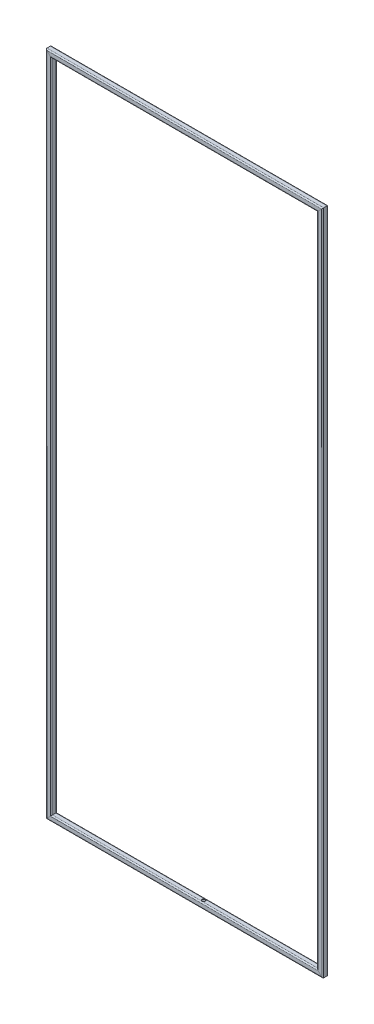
ISO-10303-21;
HEADER;
FILE_DESCRIPTION(('STEP AP214'),'2;1');
FILE_NAME('part.step','',(''),(''),'','','');
FILE_SCHEMA(('AUTOMOTIVE_DESIGN { 1 0 10303 214 1 1 1 1 }'));
ENDSEC;
DATA;
#1=APPLICATION_CONTEXT('core data for automotive mechanical design processes');
#2=APPLICATION_PROTOCOL_DEFINITION('international standard','automotive_design',2000,#1);
#3=PRODUCT_CONTEXT('',#1,'mechanical');
#4=PRODUCT('Part','Part','',(#3));
#5=PRODUCT_RELATED_PRODUCT_CATEGORY('part','',(#4));
#6=PRODUCT_DEFINITION_FORMATION('','',#4);
#7=PRODUCT_DEFINITION_CONTEXT('part definition',#1,'design');
#8=PRODUCT_DEFINITION('design','',#6,#7);
#9=PRODUCT_DEFINITION_SHAPE('','',#8);
#10=(LENGTH_UNIT() NAMED_UNIT(*) SI_UNIT(.MILLI.,.METRE.));
#11=(NAMED_UNIT(*) PLANE_ANGLE_UNIT() SI_UNIT($,.RADIAN.));
#12=(NAMED_UNIT(*) SI_UNIT($,.STERADIAN.) SOLID_ANGLE_UNIT());
#13=UNCERTAINTY_MEASURE_WITH_UNIT(LENGTH_MEASURE(1.E-05),#10,'distance_accuracy_value','');
#14=(GEOMETRIC_REPRESENTATION_CONTEXT(3) GLOBAL_UNCERTAINTY_ASSIGNED_CONTEXT((#13)) GLOBAL_UNIT_ASSIGNED_CONTEXT((#10,
#11,#12)) REPRESENTATION_CONTEXT('',''));
#15=CARTESIAN_POINT('',(0.,0.,0.));
#16=DIRECTION('',(0.,0.,1.));
#17=DIRECTION('',(1.,0.,0.));
#18=AXIS2_PLACEMENT_3D('',#15,#16,#17);
#19=CARTESIAN_POINT('',(-496.,1195.,6.));
#20=DIRECTION('',(0.,-1.,0.));
#21=DIRECTION('',(1.,0.,0.));
#22=AXIS2_PLACEMENT_3D('',#19,#20,#21);
#23=CYLINDRICAL_SURFACE('',#22,4.);
#24=CARTESIAN_POINT('',(-496.,-1201.,6.));
#25=DIRECTION('',(0.707106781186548,-0.707106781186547,0.));
#26=DIRECTION('',(-0.707106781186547,-0.707106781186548,0.));
#27=AXIS2_PLACEMENT_3D('',#24,#25,#26);
#28=ELLIPSE('',#27,5.65685424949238,4.);
#29=CARTESIAN_POINT('',(-496.,-1201.,9.99999999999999));
#30=VERTEX_POINT('',#29);
#31=CARTESIAN_POINT('',(-500.,-1205.,6.));
#32=VERTEX_POINT('',#31);
#33=EDGE_CURVE('E218',#30,#32,#28,.T.);
#34=ORIENTED_EDGE('',*,*,#33,.F.);
#35=DIRECTION('',(0.,-1.,0.));
#36=VECTOR('',#35,1.);
#37=CARTESIAN_POINT('',(-496.,1195.,9.99999999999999));
#38=LINE('',#37,#36);
#39=CARTESIAN_POINT('',(-496.,1201.,9.99999999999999));
#40=VERTEX_POINT('',#39);
#41=EDGE_CURVE('E298',#40,#30,#38,.T.);
#42=ORIENTED_EDGE('',*,*,#41,.F.);
#43=CARTESIAN_POINT('',(-496.,1201.,6.));
#44=DIRECTION('',(0.707106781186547,0.707106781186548,0.));
#45=DIRECTION('',(0.707106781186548,-0.707106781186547,0.));
#46=AXIS2_PLACEMENT_3D('',#43,#44,#45);
#47=ELLIPSE('',#46,5.65685424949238,4.);
#48=CARTESIAN_POINT('',(-500.,1205.,6.));
#49=VERTEX_POINT('',#48);
#50=EDGE_CURVE('E209',#49,#40,#47,.T.);
#51=ORIENTED_EDGE('',*,*,#50,.F.);
#52=DIRECTION('',(0.,-1.,0.));
#53=VECTOR('',#52,1.);
#54=CARTESIAN_POINT('',(-500.,1195.,6.));
#55=LINE('',#54,#53);
#56=EDGE_CURVE('E78',#49,#32,#55,.T.);
#57=ORIENTED_EDGE('',*,*,#56,.T.);
#58=EDGE_LOOP('',(#34,#42,#51,#57));
#59=FACE_BOUND('',#58,.T.);
#60=ADVANCED_FACE('F74',(#59),#23,.T.);
#61=CARTESIAN_POINT('',(-496.,1195.,9.99999999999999));
#62=DIRECTION('',(0.,0.,-1.));
#63=DIRECTION('',(-1.,0.,0.));
#64=AXIS2_PLACEMENT_3D('',#61,#62,#63);
#65=PLANE('',#64);
#66=DIRECTION('',(-0.707106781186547,-0.707106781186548,0.));
#67=VECTOR('',#66,1.);
#68=CARTESIAN_POINT('',(702.,-2.99999999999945,9.99999999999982));
#69=LINE('',#68,#67);
#70=CARTESIAN_POINT('',(-484.,-1189.,9.99999999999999));
#71=VERTEX_POINT('',#70);
#72=EDGE_CURVE('E215',#71,#30,#69,.T.);
#73=ORIENTED_EDGE('',*,*,#72,.F.);
#74=DIRECTION('',(0.,-1.,0.));
#75=VECTOR('',#74,1.);
#76=CARTESIAN_POINT('',(-484.,1195.,9.99999999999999));
#77=LINE('',#76,#75);
#78=CARTESIAN_POINT('',(-484.,1189.,9.99999999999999));
#79=VERTEX_POINT('',#78);
#80=EDGE_CURVE('E296',#79,#71,#77,.T.);
#81=ORIENTED_EDGE('',*,*,#80,.F.);
#82=DIRECTION('',(0.707106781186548,-0.707106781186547,0.));
#83=VECTOR('',#82,1.);
#84=CARTESIAN_POINT('',(-493.,1198.,9.99999999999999));
#85=LINE('',#84,#83);
#86=EDGE_CURVE('E314',#40,#79,#85,.T.);
#87=ORIENTED_EDGE('',*,*,#86,.F.);
#88=ORIENTED_EDGE('',*,*,#41,.T.);
#89=EDGE_LOOP('',(#73,#81,#87,#88));
#90=FACE_BOUND('',#89,.T.);
#91=ADVANCED_FACE('F305',(#90),#65,.F.);
#92=CARTESIAN_POINT('',(-484.,1195.,6.));
#93=DIRECTION('',(0.,-1.,0.));
#94=DIRECTION('',(1.,0.,0.));
#95=AXIS2_PLACEMENT_3D('',#92,#93,#94);
#96=CYLINDRICAL_SURFACE('',#95,4.);
#97=CARTESIAN_POINT('',(-484.,-1189.,6.));
#98=DIRECTION('',(0.707106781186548,-0.707106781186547,0.));
#99=DIRECTION('',(-0.707106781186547,-0.707106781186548,0.));
#100=AXIS2_PLACEMENT_3D('',#97,#98,#99);
#101=ELLIPSE('',#100,5.65685424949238,4.);
#102=CARTESIAN_POINT('',(-480.,-1185.,5.99999999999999));
#103=VERTEX_POINT('',#102);
#104=EDGE_CURVE('E13',#103,#71,#101,.T.);
#105=ORIENTED_EDGE('',*,*,#104,.F.);
#106=DIRECTION('',(0.,-1.,0.));
#107=VECTOR('',#106,1.);
#108=CARTESIAN_POINT('',(-480.,1195.,5.99999999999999));
#109=LINE('',#108,#107);
#110=CARTESIAN_POINT('',(-480.,1185.,5.99999999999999));
#111=VERTEX_POINT('',#110);
#112=EDGE_CURVE('E293',#111,#103,#109,.T.);
#113=ORIENTED_EDGE('',*,*,#112,.F.);
#114=CARTESIAN_POINT('',(-484.,1189.,6.));
#115=DIRECTION('',(0.707106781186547,0.707106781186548,0.));
#116=DIRECTION('',(0.707106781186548,-0.707106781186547,0.));
#117=AXIS2_PLACEMENT_3D('',#114,#115,#116);
#118=ELLIPSE('',#117,5.65685424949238,4.);
#119=EDGE_CURVE('E311',#79,#111,#118,.T.);
#120=ORIENTED_EDGE('',*,*,#119,.F.);
#121=ORIENTED_EDGE('',*,*,#80,.T.);
#122=EDGE_LOOP('',(#105,#113,#120,#121));
#123=FACE_BOUND('',#122,.T.);
#124=ADVANCED_FACE('F308',(#123),#96,.T.);
#125=CARTESIAN_POINT('',(-480.,1195.,-6.));
#126=DIRECTION('',(-1.,0.,0.));
#127=DIRECTION('',(0.,-1.,0.));
#128=AXIS2_PLACEMENT_3D('',#125,#126,#127);
#129=PLANE('',#128);
#130=DIRECTION('',(0.,0.,1.));
#131=VECTOR('',#130,1.);
#132=CARTESIAN_POINT('',(-480.,-1185.,-6.));
#133=LINE('',#132,#131);
#134=CARTESIAN_POINT('',(-480.,-1185.,-6.));
#135=VERTEX_POINT('',#134);
#136=EDGE_CURVE('E84',#135,#103,#133,.T.);
#137=ORIENTED_EDGE('',*,*,#136,.F.);
#138=DIRECTION('',(0.,-1.,0.));
#139=VECTOR('',#138,1.);
#140=CARTESIAN_POINT('',(-480.,1195.,-6.));
#141=LINE('',#140,#139);
#142=CARTESIAN_POINT('',(-480.,1185.,-6.));
#143=VERTEX_POINT('',#142);
#144=EDGE_CURVE('E290',#143,#135,#141,.T.);
#145=ORIENTED_EDGE('',*,*,#144,.F.);
#146=DIRECTION('',(0.,0.,-1.));
#147=VECTOR('',#146,1.);
#148=CARTESIAN_POINT('',(-480.,1185.,-6.));
#149=LINE('',#148,#147);
#150=EDGE_CURVE('E313',#111,#143,#149,.T.);
#151=ORIENTED_EDGE('',*,*,#150,.F.);
#152=ORIENTED_EDGE('',*,*,#112,.T.);
#153=EDGE_LOOP('',(#137,#145,#151,#152));
#154=FACE_BOUND('',#153,.T.);
#155=ADVANCED_FACE('F324',(#154),#129,.F.);
#156=CARTESIAN_POINT('',(-484.,1195.,-6.));
#157=DIRECTION('',(0.,-1.,0.));
#158=DIRECTION('',(1.,0.,0.));
#159=AXIS2_PLACEMENT_3D('',#156,#157,#158);
#160=CYLINDRICAL_SURFACE('',#159,4.);
#161=CARTESIAN_POINT('',(-484.,-1189.,-6.));
#162=DIRECTION('',(0.707106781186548,-0.707106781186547,0.));
#163=DIRECTION('',(-0.707106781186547,-0.707106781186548,0.));
#164=AXIS2_PLACEMENT_3D('',#161,#162,#163);
#165=ELLIPSE('',#164,5.65685424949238,4.);
#166=CARTESIAN_POINT('',(-484.,-1189.,-9.99999999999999));
#167=VERTEX_POINT('',#166);
#168=EDGE_CURVE('E233',#167,#135,#165,.T.);
#169=ORIENTED_EDGE('',*,*,#168,.F.);
#170=DIRECTION('',(0.,-1.,0.));
#171=VECTOR('',#170,1.);
#172=CARTESIAN_POINT('',(-484.,1195.,-9.99999999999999));
#173=LINE('',#172,#171);
#174=CARTESIAN_POINT('',(-484.,1189.,-9.99999999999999));
#175=VERTEX_POINT('',#174);
#176=EDGE_CURVE('E287',#175,#167,#173,.T.);
#177=ORIENTED_EDGE('',*,*,#176,.F.);
#178=CARTESIAN_POINT('',(-484.,1189.,-6.));
#179=DIRECTION('',(0.707106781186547,0.707106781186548,0.));
#180=DIRECTION('',(0.707106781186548,-0.707106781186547,0.));
#181=AXIS2_PLACEMENT_3D('',#178,#179,#180);
#182=ELLIPSE('',#181,5.65685424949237,4.);
#183=EDGE_CURVE('E220',#143,#175,#182,.T.);
#184=ORIENTED_EDGE('',*,*,#183,.F.);
#185=ORIENTED_EDGE('',*,*,#144,.T.);
#186=EDGE_LOOP('',(#169,#177,#184,#185));
#187=FACE_BOUND('',#186,.T.);
#188=ADVANCED_FACE('F322',(#187),#160,.T.);
#189=CARTESIAN_POINT('',(-484.,1195.,-9.99999999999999));
#190=DIRECTION('',(0.,0.,1.));
#191=DIRECTION('',(1.,0.,0.));
#192=AXIS2_PLACEMENT_3D('',#189,#190,#191);
#193=PLANE('',#192);
#194=DIRECTION('',(0.707106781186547,0.707106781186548,0.));
#195=VECTOR('',#194,1.);
#196=CARTESIAN_POINT('',(708.,3.00000000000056,-9.99999999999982));
#197=LINE('',#196,#195);
#198=CARTESIAN_POINT('',(-496.,-1201.,-10.));
#199=VERTEX_POINT('',#198);
#200=EDGE_CURVE('E236',#199,#167,#197,.T.);
#201=ORIENTED_EDGE('',*,*,#200,.F.);
#202=DIRECTION('',(0.,-1.,0.));
#203=VECTOR('',#202,1.);
#204=CARTESIAN_POINT('',(-496.,1195.,-10.));
#205=LINE('',#204,#203);
#206=CARTESIAN_POINT('',(-496.,1201.,-10.));
#207=VERTEX_POINT('',#206);
#208=EDGE_CURVE('E285',#207,#199,#205,.T.);
#209=ORIENTED_EDGE('',*,*,#208,.F.);
#210=DIRECTION('',(-0.707106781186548,0.707106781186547,0.));
#211=VECTOR('',#210,1.);
#212=CARTESIAN_POINT('',(-487.,1192.,-9.99999999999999));
#213=LINE('',#212,#211);
#214=EDGE_CURVE('E214',#175,#207,#213,.T.);
#215=ORIENTED_EDGE('',*,*,#214,.F.);
#216=ORIENTED_EDGE('',*,*,#176,.T.);
#217=EDGE_LOOP('',(#201,#209,#215,#216));
#218=FACE_BOUND('',#217,.T.);
#219=ADVANCED_FACE('F326',(#218),#193,.F.);
#220=CARTESIAN_POINT('',(-496.,1195.,-6.));
#221=DIRECTION('',(0.,-1.,0.));
#222=DIRECTION('',(1.,0.,0.));
#223=AXIS2_PLACEMENT_3D('',#220,#221,#222);
#224=CYLINDRICAL_SURFACE('',#223,4.);
#225=CARTESIAN_POINT('',(-496.,-1201.,-6.));
#226=DIRECTION('',(0.707106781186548,-0.707106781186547,0.));
#227=DIRECTION('',(-0.707106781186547,-0.707106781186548,0.));
#228=AXIS2_PLACEMENT_3D('',#225,#226,#227);
#229=ELLIPSE('',#228,5.65685424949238,4.);
#230=CARTESIAN_POINT('',(-500.,-1205.,-6.));
#231=VERTEX_POINT('',#230);
#232=EDGE_CURVE('E197',#231,#199,#229,.T.);
#233=ORIENTED_EDGE('',*,*,#232,.F.);
#234=DIRECTION('',(0.,-1.,0.));
#235=VECTOR('',#234,1.);
#236=CARTESIAN_POINT('',(-500.,1195.,-6.));
#237=LINE('',#236,#235);
#238=CARTESIAN_POINT('',(-500.,1205.,-6.));
#239=VERTEX_POINT('',#238);
#240=EDGE_CURVE('E189',#239,#231,#237,.T.);
#241=ORIENTED_EDGE('',*,*,#240,.F.);
#242=CARTESIAN_POINT('',(-496.,1201.,-6.));
#243=DIRECTION('',(0.707106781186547,0.707106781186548,0.));
#244=DIRECTION('',(0.707106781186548,-0.707106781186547,0.));
#245=AXIS2_PLACEMENT_3D('',#242,#243,#244);
#246=ELLIPSE('',#245,5.65685424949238,4.);
#247=EDGE_CURVE('E194',#207,#239,#246,.T.);
#248=ORIENTED_EDGE('',*,*,#247,.F.);
#249=ORIENTED_EDGE('',*,*,#208,.T.);
#250=EDGE_LOOP('',(#233,#241,#248,#249));
#251=FACE_BOUND('',#250,.T.);
#252=ADVANCED_FACE('F191',(#251),#224,.T.);
#253=CARTESIAN_POINT('',(-484.,1195.,6.));
#254=DIRECTION('',(0.,-1.,0.));
#255=DIRECTION('',(1.,0.,0.));
#256=AXIS2_PLACEMENT_3D('',#253,#254,#255);
#257=CYLINDRICAL_SURFACE('',#256,2.);
#258=DIRECTION('',(0.,-1.,0.));
#259=VECTOR('',#258,1.);
#260=CARTESIAN_POINT('',(-482.,1195.,6.));
#261=LINE('',#260,#259);
#262=CARTESIAN_POINT('',(-482.,1187.,6.));
#263=VERTEX_POINT('',#262);
#264=CARTESIAN_POINT('',(-482.,-1187.,6.));
#265=VERTEX_POINT('',#264);
#266=EDGE_CURVE('E242',#263,#265,#261,.T.);
#267=ORIENTED_EDGE('',*,*,#266,.T.);
#268=CARTESIAN_POINT('',(-484.,-1189.,6.));
#269=DIRECTION('',(0.707106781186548,-0.707106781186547,0.));
#270=DIRECTION('',(-0.707106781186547,-0.707106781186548,0.));
#271=AXIS2_PLACEMENT_3D('',#268,#269,#270);
#272=ELLIPSE('',#271,2.8284271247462,2.);
#273=CARTESIAN_POINT('',(-484.,-1189.,8.));
#274=VERTEX_POINT('',#273);
#275=EDGE_CURVE('E120',#265,#274,#272,.T.);
#276=ORIENTED_EDGE('',*,*,#275,.T.);
#277=DIRECTION('',(0.,-1.,0.));
#278=VECTOR('',#277,1.);
#279=CARTESIAN_POINT('',(-484.,1195.,8.));
#280=LINE('',#279,#278);
#281=CARTESIAN_POINT('',(-484.,1189.,8.));
#282=VERTEX_POINT('',#281);
#283=EDGE_CURVE('E245',#282,#274,#280,.T.);
#284=ORIENTED_EDGE('',*,*,#283,.F.);
#285=CARTESIAN_POINT('',(-484.,1189.,6.));
#286=DIRECTION('',(0.707106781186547,0.707106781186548,0.));
#287=DIRECTION('',(0.707106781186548,-0.707106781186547,0.));
#288=AXIS2_PLACEMENT_3D('',#285,#286,#287);
#289=ELLIPSE('',#288,2.82842712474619,2.);
#290=EDGE_CURVE('E241',#282,#263,#289,.T.);
#291=ORIENTED_EDGE('',*,*,#290,.T.);
#292=EDGE_LOOP('',(#267,#276,#284,#291));
#293=FACE_BOUND('',#292,.T.);
#294=ADVANCED_FACE('F333',(#293),#257,.F.);
#295=CARTESIAN_POINT('',(-496.,1195.,8.00000000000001));
#296=DIRECTION('',(0.,0.,-1.));
#297=DIRECTION('',(-1.,0.,0.));
#298=AXIS2_PLACEMENT_3D('',#295,#296,#297);
#299=PLANE('',#298);
#300=ORIENTED_EDGE('',*,*,#283,.T.);
#301=DIRECTION('',(-0.707106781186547,-0.707106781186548,0.));
#302=VECTOR('',#301,1.);
#303=CARTESIAN_POINT('',(702.,-2.99999999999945,7.99999999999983));
#304=LINE('',#303,#302);
#305=CARTESIAN_POINT('',(-496.,-1201.,8.00000000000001));
#306=VERTEX_POINT('',#305);
#307=EDGE_CURVE('E93',#274,#306,#304,.T.);
#308=ORIENTED_EDGE('',*,*,#307,.T.);
#309=DIRECTION('',(0.,-1.,0.));
#310=VECTOR('',#309,1.);
#311=CARTESIAN_POINT('',(-496.,1195.,8.00000000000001));
#312=LINE('',#311,#310);
#313=CARTESIAN_POINT('',(-496.,1201.,8.00000000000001));
#314=VERTEX_POINT('',#313);
#315=EDGE_CURVE('E250',#314,#306,#312,.T.);
#316=ORIENTED_EDGE('',*,*,#315,.F.);
#317=DIRECTION('',(0.707106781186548,-0.707106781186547,0.));
#318=VECTOR('',#317,1.);
#319=CARTESIAN_POINT('',(-493.,1198.,8.00000000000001));
#320=LINE('',#319,#318);
#321=EDGE_CURVE('E244',#314,#282,#320,.T.);
#322=ORIENTED_EDGE('',*,*,#321,.T.);
#323=EDGE_LOOP('',(#300,#308,#316,#322));
#324=FACE_BOUND('',#323,.T.);
#325=ADVANCED_FACE('F375',(#324),#299,.T.);
#326=CARTESIAN_POINT('',(-496.,1195.,6.));
#327=DIRECTION('',(0.,-1.,0.));
#328=DIRECTION('',(1.,0.,0.));
#329=AXIS2_PLACEMENT_3D('',#326,#327,#328);
#330=CYLINDRICAL_SURFACE('',#329,2.);
#331=ORIENTED_EDGE('',*,*,#315,.T.);
#332=CARTESIAN_POINT('',(-496.,-1201.,6.));
#333=DIRECTION('',(0.707106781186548,-0.707106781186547,0.));
#334=DIRECTION('',(-0.707106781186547,-0.707106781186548,0.));
#335=AXIS2_PLACEMENT_3D('',#332,#333,#334);
#336=ELLIPSE('',#335,2.8284271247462,2.);
#337=CARTESIAN_POINT('',(-498.,-1203.,6.));
#338=VERTEX_POINT('',#337);
#339=EDGE_CURVE('E246',#306,#338,#336,.T.);
#340=ORIENTED_EDGE('',*,*,#339,.T.);
#341=DIRECTION('',(0.,-1.,0.));
#342=VECTOR('',#341,1.);
#343=CARTESIAN_POINT('',(-498.,1195.,6.));
#344=LINE('',#343,#342);
#345=CARTESIAN_POINT('',(-498.,1203.,6.));
#346=VERTEX_POINT('',#345);
#347=EDGE_CURVE('E255',#346,#338,#344,.T.);
#348=ORIENTED_EDGE('',*,*,#347,.F.);
#349=CARTESIAN_POINT('',(-496.,1201.,6.));
#350=DIRECTION('',(0.707106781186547,0.707106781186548,0.));
#351=DIRECTION('',(0.707106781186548,-0.707106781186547,0.));
#352=AXIS2_PLACEMENT_3D('',#349,#350,#351);
#353=ELLIPSE('',#352,2.82842712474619,2.);
#354=EDGE_CURVE('E249',#346,#314,#353,.T.);
#355=ORIENTED_EDGE('',*,*,#354,.T.);
#356=EDGE_LOOP('',(#331,#340,#348,#355));
#357=FACE_BOUND('',#356,.T.);
#358=ADVANCED_FACE('F386',(#357),#330,.F.);
#359=CARTESIAN_POINT('',(-498.,1195.,6.));
#360=DIRECTION('',(1.,0.,0.));
#361=DIRECTION('',(0.,1.,0.));
#362=AXIS2_PLACEMENT_3D('',#359,#360,#361);
#363=PLANE('',#362);
#364=ORIENTED_EDGE('',*,*,#347,.T.);
#365=DIRECTION('',(0.,0.,-1.));
#366=VECTOR('',#365,1.);
#367=CARTESIAN_POINT('',(-498.,-1203.,6.));
#368=LINE('',#367,#366);
#369=CARTESIAN_POINT('',(-498.,-1203.,-6.));
#370=VERTEX_POINT('',#369);
#371=EDGE_CURVE('E251',#338,#370,#368,.T.);
#372=ORIENTED_EDGE('',*,*,#371,.T.);
#373=DIRECTION('',(0.,-1.,0.));
#374=VECTOR('',#373,1.);
#375=CARTESIAN_POINT('',(-498.,1195.,-6.));
#376=LINE('',#375,#374);
#377=CARTESIAN_POINT('',(-498.,1203.,-6.));
#378=VERTEX_POINT('',#377);
#379=EDGE_CURVE('E260',#378,#370,#376,.T.);
#380=ORIENTED_EDGE('',*,*,#379,.F.);
#381=DIRECTION('',(0.,0.,1.));
#382=VECTOR('',#381,1.);
#383=CARTESIAN_POINT('',(-498.,1203.,6.));
#384=LINE('',#383,#382);
#385=EDGE_CURVE('E254',#378,#346,#384,.T.);
#386=ORIENTED_EDGE('',*,*,#385,.T.);
#387=EDGE_LOOP('',(#364,#372,#380,#386));
#388=FACE_BOUND('',#387,.T.);
#389=ADVANCED_FACE('F397',(#388),#363,.T.);
#390=CARTESIAN_POINT('',(-496.,1195.,-6.));
#391=DIRECTION('',(0.,-1.,0.));
#392=DIRECTION('',(1.,0.,0.));
#393=AXIS2_PLACEMENT_3D('',#390,#391,#392);
#394=CYLINDRICAL_SURFACE('',#393,2.);
#395=ORIENTED_EDGE('',*,*,#379,.T.);
#396=CARTESIAN_POINT('',(-496.,-1201.,-6.));
#397=DIRECTION('',(0.707106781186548,-0.707106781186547,0.));
#398=DIRECTION('',(-0.707106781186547,-0.707106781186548,0.));
#399=AXIS2_PLACEMENT_3D('',#396,#397,#398);
#400=ELLIPSE('',#399,2.8284271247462,2.);
#401=CARTESIAN_POINT('',(-496.,-1201.,-8.00000000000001));
#402=VERTEX_POINT('',#401);
#403=EDGE_CURVE('E256',#370,#402,#400,.T.);
#404=ORIENTED_EDGE('',*,*,#403,.T.);
#405=DIRECTION('',(0.,-1.,0.));
#406=VECTOR('',#405,1.);
#407=CARTESIAN_POINT('',(-496.,1195.,-8.));
#408=LINE('',#407,#406);
#409=CARTESIAN_POINT('',(-496.,1201.,-8.00000000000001));
#410=VERTEX_POINT('',#409);
#411=EDGE_CURVE('E265',#410,#402,#408,.T.);
#412=ORIENTED_EDGE('',*,*,#411,.F.);
#413=CARTESIAN_POINT('',(-496.,1201.,-6.));
#414=DIRECTION('',(0.707106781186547,0.707106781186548,0.));
#415=DIRECTION('',(0.707106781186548,-0.707106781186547,0.));
#416=AXIS2_PLACEMENT_3D('',#413,#414,#415);
#417=ELLIPSE('',#416,2.82842712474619,2.);
#418=EDGE_CURVE('E259',#410,#378,#417,.T.);
#419=ORIENTED_EDGE('',*,*,#418,.T.);
#420=EDGE_LOOP('',(#395,#404,#412,#419));
#421=FACE_BOUND('',#420,.T.);
#422=ADVANCED_FACE('F408',(#421),#394,.F.);
#423=CARTESIAN_POINT('',(-484.,1195.,-8.));
#424=DIRECTION('',(0.,0.,1.));
#425=DIRECTION('',(1.,0.,0.));
#426=AXIS2_PLACEMENT_3D('',#423,#424,#425);
#427=PLANE('',#426);
#428=ORIENTED_EDGE('',*,*,#411,.T.);
#429=DIRECTION('',(0.707106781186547,0.707106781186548,0.));
#430=VECTOR('',#429,1.);
#431=CARTESIAN_POINT('',(708.,3.00000000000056,-7.99999999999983));
#432=LINE('',#431,#430);
#433=CARTESIAN_POINT('',(-484.,-1189.,-8.));
#434=VERTEX_POINT('',#433);
#435=EDGE_CURVE('E261',#402,#434,#432,.T.);
#436=ORIENTED_EDGE('',*,*,#435,.T.);
#437=DIRECTION('',(0.,-1.,0.));
#438=VECTOR('',#437,1.);
#439=CARTESIAN_POINT('',(-484.,1195.,-8.));
#440=LINE('',#439,#438);
#441=CARTESIAN_POINT('',(-484.,1189.,-8.));
#442=VERTEX_POINT('',#441);
#443=EDGE_CURVE('E269',#442,#434,#440,.T.);
#444=ORIENTED_EDGE('',*,*,#443,.F.);
#445=DIRECTION('',(-0.707106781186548,0.707106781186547,0.));
#446=VECTOR('',#445,1.);
#447=CARTESIAN_POINT('',(-487.,1192.,-8.));
#448=LINE('',#447,#446);
#449=EDGE_CURVE('E264',#442,#410,#448,.T.);
#450=ORIENTED_EDGE('',*,*,#449,.T.);
#451=EDGE_LOOP('',(#428,#436,#444,#450));
#452=FACE_BOUND('',#451,.T.);
#453=ADVANCED_FACE('F419',(#452),#427,.T.);
#454=CARTESIAN_POINT('',(-484.,1195.,-6.));
#455=DIRECTION('',(0.,-1.,0.));
#456=DIRECTION('',(1.,0.,0.));
#457=AXIS2_PLACEMENT_3D('',#454,#455,#456);
#458=CYLINDRICAL_SURFACE('',#457,2.);
#459=ORIENTED_EDGE('',*,*,#443,.T.);
#460=CARTESIAN_POINT('',(-484.,-1189.,-6.));
#461=DIRECTION('',(0.707106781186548,-0.707106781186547,0.));
#462=DIRECTION('',(-0.707106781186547,-0.707106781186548,0.));
#463=AXIS2_PLACEMENT_3D('',#460,#461,#462);
#464=ELLIPSE('',#463,2.82842712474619,2.);
#465=CARTESIAN_POINT('',(-482.,-1187.,-6.));
#466=VERTEX_POINT('',#465);
#467=EDGE_CURVE('E266',#434,#466,#464,.T.);
#468=ORIENTED_EDGE('',*,*,#467,.T.);
#469=DIRECTION('',(0.,-1.,0.));
#470=VECTOR('',#469,1.);
#471=CARTESIAN_POINT('',(-482.,1195.,-6.));
#472=LINE('',#471,#470);
#473=CARTESIAN_POINT('',(-482.,1187.,-6.));
#474=VERTEX_POINT('',#473);
#475=EDGE_CURVE('E227',#474,#466,#472,.T.);
#476=ORIENTED_EDGE('',*,*,#475,.F.);
#477=CARTESIAN_POINT('',(-484.,1189.,-6.));
#478=DIRECTION('',(0.707106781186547,0.707106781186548,0.));
#479=DIRECTION('',(0.707106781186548,-0.707106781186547,0.));
#480=AXIS2_PLACEMENT_3D('',#477,#478,#479);
#481=ELLIPSE('',#480,2.82842712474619,2.);
#482=EDGE_CURVE('E268',#474,#442,#481,.T.);
#483=ORIENTED_EDGE('',*,*,#482,.T.);
#484=EDGE_LOOP('',(#459,#468,#476,#483));
#485=FACE_BOUND('',#484,.T.);
#486=ADVANCED_FACE('F430',(#485),#458,.F.);
#487=CARTESIAN_POINT('',(-482.,1195.,-6.));
#488=DIRECTION('',(-1.,0.,0.));
#489=DIRECTION('',(0.,-1.,0.));
#490=AXIS2_PLACEMENT_3D('',#487,#488,#489);
#491=PLANE('',#490);
#492=ORIENTED_EDGE('',*,*,#475,.T.);
#493=DIRECTION('',(0.,0.,1.));
#494=VECTOR('',#493,1.);
#495=CARTESIAN_POINT('',(-482.,-1187.,-6.));
#496=LINE('',#495,#494);
#497=EDGE_CURVE('E115',#466,#265,#496,.T.);
#498=ORIENTED_EDGE('',*,*,#497,.T.);
#499=ORIENTED_EDGE('',*,*,#266,.F.);
#500=DIRECTION('',(0.,0.,-1.));
#501=VECTOR('',#500,1.);
#502=CARTESIAN_POINT('',(-482.,1187.,-6.));
#503=LINE('',#502,#501);
#504=EDGE_CURVE('E202',#263,#474,#503,.T.);
#505=ORIENTED_EDGE('',*,*,#504,.T.);
#506=EDGE_LOOP('',(#492,#498,#499,#505));
#507=FACE_BOUND('',#506,.T.);
#508=ADVANCED_FACE('F441',(#507),#491,.T.);
#509=CARTESIAN_POINT('',(-500.,1195.,6.));
#510=DIRECTION('',(1.,0.,0.));
#511=DIRECTION('',(0.,1.,0.));
#512=AXIS2_PLACEMENT_3D('',#509,#510,#511);
#513=PLANE('',#512);
#514=DIRECTION('',(0.,0.,-1.));
#515=VECTOR('',#514,1.);
#516=CARTESIAN_POINT('',(-500.,-1205.,6.));
#517=LINE('',#516,#515);
#518=EDGE_CURVE('E229',#32,#231,#517,.T.);
#519=ORIENTED_EDGE('',*,*,#518,.F.);
#520=ORIENTED_EDGE('',*,*,#56,.F.);
#521=DIRECTION('',(0.,0.,1.));
#522=VECTOR('',#521,1.);
#523=CARTESIAN_POINT('',(-500.,1205.,6.));
#524=LINE('',#523,#522);
#525=EDGE_CURVE('E201',#239,#49,#524,.T.);
#526=ORIENTED_EDGE('',*,*,#525,.F.);
#527=ORIENTED_EDGE('',*,*,#240,.T.);
#528=EDGE_LOOP('',(#519,#520,#526,#527));
#529=FACE_BOUND('',#528,.T.);
#530=ADVANCED_FACE('F205',(#529),#513,.F.);
#531=CARTESIAN_POINT('',(-490.,1195.,0.));
#532=DIRECTION('',(0.707106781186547,0.707106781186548,0.));
#533=DIRECTION('',(-0.707106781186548,0.707106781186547,0.));
#534=AXIS2_PLACEMENT_3D('',#531,#532,#533);
#535=PLANE('',#534);
#536=ORIENTED_EDGE('',*,*,#290,.F.);
#537=ORIENTED_EDGE('',*,*,#321,.F.);
#538=ORIENTED_EDGE('',*,*,#354,.F.);
#539=ORIENTED_EDGE('',*,*,#385,.F.);
#540=ORIENTED_EDGE('',*,*,#418,.F.);
#541=ORIENTED_EDGE('',*,*,#449,.F.);
#542=ORIENTED_EDGE('',*,*,#482,.F.);
#543=ORIENTED_EDGE('',*,*,#504,.F.);
#544=EDGE_LOOP('',(#536,#537,#538,#539,#540,#541,#542,#543));
#545=FACE_BOUND('',#544,.T.);
#546=ORIENTED_EDGE('',*,*,#525,.T.);
#547=ORIENTED_EDGE('',*,*,#50,.T.);
#548=ORIENTED_EDGE('',*,*,#86,.T.);
#549=ORIENTED_EDGE('',*,*,#119,.T.);
#550=ORIENTED_EDGE('',*,*,#150,.T.);
#551=ORIENTED_EDGE('',*,*,#183,.T.);
#552=ORIENTED_EDGE('',*,*,#214,.T.);
#553=ORIENTED_EDGE('',*,*,#247,.T.);
#554=EDGE_LOOP('',(#546,#547,#548,#549,#550,#551,#552,#553));
#555=FACE_BOUND('',#554,.T.);
#556=ADVANCED_FACE('F212',(#545,#555),#535,.T.);
#557=CARTESIAN_POINT('',(-490.,-1195.,0.));
#558=DIRECTION('',(0.707106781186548,-0.707106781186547,0.));
#559=DIRECTION('',(0.707106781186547,0.707106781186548,0.));
#560=AXIS2_PLACEMENT_3D('',#557,#558,#559);
#561=PLANE('',#560);
#562=ORIENTED_EDGE('',*,*,#275,.F.);
#563=ORIENTED_EDGE('',*,*,#497,.F.);
#564=ORIENTED_EDGE('',*,*,#467,.F.);
#565=ORIENTED_EDGE('',*,*,#435,.F.);
#566=ORIENTED_EDGE('',*,*,#403,.F.);
#567=ORIENTED_EDGE('',*,*,#371,.F.);
#568=ORIENTED_EDGE('',*,*,#339,.F.);
#569=ORIENTED_EDGE('',*,*,#307,.F.);
#570=EDGE_LOOP('',(#562,#563,#564,#565,#566,#567,#568,#569));
#571=FACE_BOUND('',#570,.T.);
#572=ORIENTED_EDGE('',*,*,#72,.T.);
#573=ORIENTED_EDGE('',*,*,#33,.T.);
#574=ORIENTED_EDGE('',*,*,#518,.T.);
#575=ORIENTED_EDGE('',*,*,#232,.T.);
#576=ORIENTED_EDGE('',*,*,#200,.T.);
#577=ORIENTED_EDGE('',*,*,#168,.T.);
#578=ORIENTED_EDGE('',*,*,#136,.T.);
#579=ORIENTED_EDGE('',*,*,#104,.T.);
#580=EDGE_LOOP('',(#572,#573,#574,#575,#576,#577,#578,#579));
#581=FACE_BOUND('',#580,.T.);
#582=ADVANCED_FACE('F76',(#571,#581),#561,.T.);
#583=CLOSED_SHELL('',(#60,#91,#124,#155,#188,#219,#252,#294,#325,#358,#389,#422,#453,#486,#508,
#530,#556,#582));
#584=MANIFOLD_SOLID_BREP('B2',#583);
#585=CARTESIAN_POINT('',(-490.,-1185.,-6.));
#586=DIRECTION('',(0.,-1.,0.));
#587=DIRECTION('',(1.,0.,0.));
#588=AXIS2_PLACEMENT_3D('',#585,#586,#587);
#589=PLANE('',#588);
#590=DIRECTION('',(1.,0.,0.));
#591=VECTOR('',#590,1.);
#592=CARTESIAN_POINT('',(-490.,-1185.,6.));
#593=LINE('',#592,#591);
#594=CARTESIAN_POINT('',(-480.,-1185.,6.));
#595=VERTEX_POINT('',#594);
#596=CARTESIAN_POINT('',(60.0000000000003,-1185.,6.));
#597=VERTEX_POINT('',#596);
#598=EDGE_CURVE('E708',#595,#597,#593,.T.);
#599=ORIENTED_EDGE('',*,*,#598,.T.);
#600=CARTESIAN_POINT('',(60.0000000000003,-1185.,0.));
#601=DIRECTION('',(0.,1.,0.));
#602=DIRECTION('',(-1.,0.,0.));
#603=AXIS2_PLACEMENT_3D('',#600,#601,#602);
#604=CIRCLE('',#603,6.);
#605=CARTESIAN_POINT('',(60.0000000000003,-1185.,-6.));
#606=VERTEX_POINT('',#605);
#607=EDGE_CURVE('E588',#606,#597,#604,.T.);
#608=ORIENTED_EDGE('',*,*,#607,.F.);
#609=DIRECTION('',(1.,0.,0.));
#610=VECTOR('',#609,1.);
#611=CARTESIAN_POINT('',(-490.,-1185.,-6.));
#612=LINE('',#611,#610);
#613=CARTESIAN_POINT('',(-480.,-1185.,-6.));
#614=VERTEX_POINT('',#613);
#615=EDGE_CURVE('E705',#614,#606,#612,.T.);
#616=ORIENTED_EDGE('',*,*,#615,.F.);
#617=DIRECTION('',(0.,0.,-1.));
#618=VECTOR('',#617,1.);
#619=CARTESIAN_POINT('',(-480.,-1185.,-6.));
#620=LINE('',#619,#618);
#621=EDGE_CURVE('E779',#595,#614,#620,.T.);
#622=ORIENTED_EDGE('',*,*,#621,.F.);
#623=EDGE_LOOP('',(#599,#608,#616,#622));
#624=FACE_BOUND('',#623,.T.);
#625=ADVANCED_FACE('F574',(#624),#589,.F.);
#626=CARTESIAN_POINT('',(-490.,-1187.,-6.));
#627=DIRECTION('',(0.,-1.,0.));
#628=DIRECTION('',(1.,0.,0.));
#629=AXIS2_PLACEMENT_3D('',#626,#627,#628);
#630=PLANE('',#629);
#631=CARTESIAN_POINT('',(60.0000000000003,-1187.,0.));
#632=DIRECTION('',(0.,-1.,0.));
#633=DIRECTION('',(1.,0.,0.));
#634=AXIS2_PLACEMENT_3D('',#631,#632,#633);
#635=CIRCLE('',#634,6.);
#636=CARTESIAN_POINT('',(60.0000000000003,-1187.,6.));
#637=VERTEX_POINT('',#636);
#638=CARTESIAN_POINT('',(60.0000000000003,-1187.,-6.));
#639=VERTEX_POINT('',#638);
#640=EDGE_CURVE('E72',#637,#639,#635,.T.);
#641=ORIENTED_EDGE('',*,*,#640,.F.);
#642=DIRECTION('',(1.,0.,0.));
#643=VECTOR('',#642,1.);
#644=CARTESIAN_POINT('',(-490.,-1187.,6.));
#645=LINE('',#644,#643);
#646=CARTESIAN_POINT('',(-482.,-1187.,6.));
#647=VERTEX_POINT('',#646);
#648=EDGE_CURVE('E834',#647,#637,#645,.T.);
#649=ORIENTED_EDGE('',*,*,#648,.F.);
#650=DIRECTION('',(0.,0.,-1.));
#651=VECTOR('',#650,1.);
#652=CARTESIAN_POINT('',(-482.,-1187.,-6.));
#653=LINE('',#652,#651);
#654=CARTESIAN_POINT('',(-482.,-1187.,-6.));
#655=VERTEX_POINT('',#654);
#656=EDGE_CURVE('E767',#647,#655,#653,.T.);
#657=ORIENTED_EDGE('',*,*,#656,.T.);
#658=DIRECTION('',(1.,0.,0.));
#659=VECTOR('',#658,1.);
#660=CARTESIAN_POINT('',(-490.,-1187.,-6.));
#661=LINE('',#660,#659);
#662=EDGE_CURVE('E766',#655,#639,#661,.T.);
#663=ORIENTED_EDGE('',*,*,#662,.T.);
#664=EDGE_LOOP('',(#641,#649,#657,#663));
#665=FACE_BOUND('',#664,.T.);
#666=ADVANCED_FACE('F868',(#665),#630,.T.);
#667=CARTESIAN_POINT('',(-490.,-1201.,6.));
#668=DIRECTION('',(1.,0.,0.));
#669=DIRECTION('',(0.,1.,0.));
#670=AXIS2_PLACEMENT_3D('',#667,#668,#669);
#671=CYLINDRICAL_SURFACE('',#670,4.);
#672=CARTESIAN_POINT('',(-496.,-1201.,6.));
#673=DIRECTION('',(-0.707106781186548,0.707106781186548,0.));
#674=DIRECTION('',(0.707106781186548,0.707106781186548,0.));
#675=AXIS2_PLACEMENT_3D('',#672,#673,#674);
#676=ELLIPSE('',#675,5.65685424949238,4.);
#677=CARTESIAN_POINT('',(-500.,-1205.,6.));
#678=VERTEX_POINT('',#677);
#679=CARTESIAN_POINT('',(-496.,-1201.,9.99999999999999));
#680=VERTEX_POINT('',#679);
#681=EDGE_CURVE('E742',#678,#680,#676,.T.);
#682=ORIENTED_EDGE('',*,*,#681,.F.);
#683=DIRECTION('',(1.,0.,0.));
#684=VECTOR('',#683,1.);
#685=CARTESIAN_POINT('',(-490.,-1205.,6.));
#686=LINE('',#685,#684);
#687=CARTESIAN_POINT('',(500.,-1205.,6.));
#688=VERTEX_POINT('',#687);
#689=EDGE_CURVE('E699',#678,#688,#686,.T.);
#690=ORIENTED_EDGE('',*,*,#689,.T.);
#691=CARTESIAN_POINT('',(496.,-1201.,6.));
#692=DIRECTION('',(0.707106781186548,0.707106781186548,0.));
#693=DIRECTION('',(0.707106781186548,-0.707106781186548,0.));
#694=AXIS2_PLACEMENT_3D('',#691,#692,#693);
#695=ELLIPSE('',#694,5.65685424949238,4.);
#696=CARTESIAN_POINT('',(496.,-1201.,9.99999999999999));
#697=VERTEX_POINT('',#696);
#698=EDGE_CURVE('E739',#697,#688,#695,.T.);
#699=ORIENTED_EDGE('',*,*,#698,.F.);
#700=DIRECTION('',(1.,0.,0.));
#701=VECTOR('',#700,1.);
#702=CARTESIAN_POINT('',(-490.,-1201.,9.99999999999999));
#703=LINE('',#702,#701);
#704=EDGE_CURVE('E731',#680,#697,#703,.T.);
#705=ORIENTED_EDGE('',*,*,#704,.F.);
#706=EDGE_LOOP('',(#682,#690,#699,#705));
#707=FACE_BOUND('',#706,.T.);
#708=ADVANCED_FACE('F736',(#707),#671,.T.);
#709=CARTESIAN_POINT('',(-490.,-1201.,9.99999999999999));
#710=DIRECTION('',(0.,0.,-1.));
#711=DIRECTION('',(0.,1.,0.));
#712=AXIS2_PLACEMENT_3D('',#709,#710,#711);
#713=PLANE('',#712);
#714=DIRECTION('',(0.707106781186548,0.707106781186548,0.));
#715=VECTOR('',#714,1.);
#716=CARTESIAN_POINT('',(-493.,-1198.,9.99999999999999));
#717=LINE('',#716,#715);
#718=CARTESIAN_POINT('',(-484.,-1189.,9.99999999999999));
#719=VERTEX_POINT('',#718);
#720=EDGE_CURVE('E784',#680,#719,#717,.T.);
#721=ORIENTED_EDGE('',*,*,#720,.F.);
#722=ORIENTED_EDGE('',*,*,#704,.T.);
#723=DIRECTION('',(0.707106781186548,-0.707106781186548,0.));
#724=VECTOR('',#723,1.);
#725=CARTESIAN_POINT('',(2.99999999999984,-708.,9.99999999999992));
#726=LINE('',#725,#724);
#727=CARTESIAN_POINT('',(484.,-1189.,10.));
#728=VERTEX_POINT('',#727);
#729=EDGE_CURVE('E758',#728,#697,#726,.T.);
#730=ORIENTED_EDGE('',*,*,#729,.F.);
#731=DIRECTION('',(1.,0.,0.));
#732=VECTOR('',#731,1.);
#733=CARTESIAN_POINT('',(-490.,-1189.,9.99999999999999));
#734=LINE('',#733,#732);
#735=EDGE_CURVE('E729',#719,#728,#734,.T.);
#736=ORIENTED_EDGE('',*,*,#735,.F.);
#737=EDGE_LOOP('',(#721,#722,#730,#736));
#738=FACE_BOUND('',#737,.T.);
#739=ADVANCED_FACE('F856',(#738),#713,.F.);
#740=CARTESIAN_POINT('',(-490.,-1189.,6.));
#741=DIRECTION('',(1.,0.,0.));
#742=DIRECTION('',(0.,1.,0.));
#743=AXIS2_PLACEMENT_3D('',#740,#741,#742);
#744=CYLINDRICAL_SURFACE('',#743,4.);
#745=CARTESIAN_POINT('',(-484.,-1189.,6.));
#746=DIRECTION('',(-0.707106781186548,0.707106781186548,0.));
#747=DIRECTION('',(0.707106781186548,0.707106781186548,0.));
#748=AXIS2_PLACEMENT_3D('',#745,#746,#747);
#749=ELLIPSE('',#748,5.65685424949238,4.);
#750=EDGE_CURVE('E781',#719,#595,#749,.T.);
#751=ORIENTED_EDGE('',*,*,#750,.F.);
#752=ORIENTED_EDGE('',*,*,#735,.T.);
#753=CARTESIAN_POINT('',(484.,-1189.,6.));
#754=DIRECTION('',(0.707106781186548,0.707106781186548,0.));
#755=DIRECTION('',(0.707106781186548,-0.707106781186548,0.));
#756=AXIS2_PLACEMENT_3D('',#753,#754,#755);
#757=ELLIPSE('',#756,5.65685424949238,4.);
#758=CARTESIAN_POINT('',(480.,-1185.,6.));
#759=VERTEX_POINT('',#758);
#760=EDGE_CURVE('E824',#759,#728,#757,.T.);
#761=ORIENTED_EDGE('',*,*,#760,.F.);
#762=EDGE_CURVE('E728',#597,#759,#593,.T.);
#763=ORIENTED_EDGE('',*,*,#762,.F.);
#764=ORIENTED_EDGE('',*,*,#598,.F.);
#765=EDGE_LOOP('',(#751,#752,#761,#763,#764));
#766=FACE_BOUND('',#765,.T.);
#767=ADVANCED_FACE('F853',(#766),#744,.T.);
#768=CARTESIAN_POINT('',(480.,-1185.,-6.));
#769=VERTEX_POINT('',#768);
#770=EDGE_CURVE('E710',#606,#769,#612,.T.);
#771=ORIENTED_EDGE('',*,*,#770,.F.);
#772=EDGE_CURVE('E694',#597,#606,#604,.T.);
#773=ORIENTED_EDGE('',*,*,#772,.F.);
#774=ORIENTED_EDGE('',*,*,#762,.T.);
#775=DIRECTION('',(0.,0.,1.));
#776=VECTOR('',#775,1.);
#777=CARTESIAN_POINT('',(480.,-1185.,-6.));
#778=LINE('',#777,#776);
#779=EDGE_CURVE('E713',#769,#759,#778,.T.);
#780=ORIENTED_EDGE('',*,*,#779,.F.);
#781=EDGE_LOOP('',(#771,#773,#774,#780));
#782=FACE_BOUND('',#781,.T.);
#783=ADVANCED_FACE('F711',(#782),#589,.F.);
#784=CARTESIAN_POINT('',(-490.,-1189.,-6.));
#785=DIRECTION('',(1.,0.,0.));
#786=DIRECTION('',(0.,1.,0.));
#787=AXIS2_PLACEMENT_3D('',#784,#785,#786);
#788=CYLINDRICAL_SURFACE('',#787,4.);
#789=CARTESIAN_POINT('',(-484.,-1189.,-6.));
#790=DIRECTION('',(-0.707106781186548,0.707106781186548,0.));
#791=DIRECTION('',(0.707106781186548,0.707106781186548,0.));
#792=AXIS2_PLACEMENT_3D('',#789,#790,#791);
#793=ELLIPSE('',#792,5.65685424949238,4.);
#794=CARTESIAN_POINT('',(-484.,-1189.,-9.99999999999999));
#795=VERTEX_POINT('',#794);
#796=EDGE_CURVE('E721',#614,#795,#793,.T.);
#797=ORIENTED_EDGE('',*,*,#796,.F.);
#798=ORIENTED_EDGE('',*,*,#615,.T.);
#799=ORIENTED_EDGE('',*,*,#770,.T.);
#800=CARTESIAN_POINT('',(484.,-1189.,-6.));
#801=DIRECTION('',(0.707106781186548,0.707106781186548,0.));
#802=DIRECTION('',(0.707106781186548,-0.707106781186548,0.));
#803=AXIS2_PLACEMENT_3D('',#800,#801,#802);
#804=ELLIPSE('',#803,5.65685424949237,4.);
#805=CARTESIAN_POINT('',(484.,-1189.,-9.99999999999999));
#806=VERTEX_POINT('',#805);
#807=EDGE_CURVE('E844',#806,#769,#804,.T.);
#808=ORIENTED_EDGE('',*,*,#807,.F.);
#809=DIRECTION('',(1.,0.,0.));
#810=VECTOR('',#809,1.);
#811=CARTESIAN_POINT('',(-490.,-1189.,-9.99999999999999));
#812=LINE('',#811,#810);
#813=EDGE_CURVE('E722',#795,#806,#812,.T.);
#814=ORIENTED_EDGE('',*,*,#813,.F.);
#815=EDGE_LOOP('',(#797,#798,#799,#808,#814));
#816=FACE_BOUND('',#815,.T.);
#817=ADVANCED_FACE('F718',(#816),#788,.T.);
#818=CARTESIAN_POINT('',(-490.,-1189.,-9.99999999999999));
#819=DIRECTION('',(0.,0.,1.));
#820=DIRECTION('',(0.,-1.,0.));
#821=AXIS2_PLACEMENT_3D('',#818,#819,#820);
#822=PLANE('',#821);
#823=DIRECTION('',(-0.707106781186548,-0.707106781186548,0.));
#824=VECTOR('',#823,1.);
#825=CARTESIAN_POINT('',(-487.,-1192.,-9.99999999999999));
#826=LINE('',#825,#824);
#827=CARTESIAN_POINT('',(-496.,-1201.,-10.));
#828=VERTEX_POINT('',#827);
#829=EDGE_CURVE('E775',#795,#828,#826,.T.);
#830=ORIENTED_EDGE('',*,*,#829,.F.);
#831=ORIENTED_EDGE('',*,*,#813,.T.);
#832=DIRECTION('',(-0.707106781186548,0.707106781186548,0.));
#833=VECTOR('',#832,1.);
#834=CARTESIAN_POINT('',(-3.00000000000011,-702.,-9.99999999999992));
#835=LINE('',#834,#833);
#836=CARTESIAN_POINT('',(496.,-1201.,-10.));
#837=VERTEX_POINT('',#836);
#838=EDGE_CURVE('E842',#837,#806,#835,.T.);
#839=ORIENTED_EDGE('',*,*,#838,.F.);
#840=DIRECTION('',(1.,0.,0.));
#841=VECTOR('',#840,1.);
#842=CARTESIAN_POINT('',(-490.,-1201.,-10.));
#843=LINE('',#842,#841);
#844=EDGE_CURVE('E723',#828,#837,#843,.T.);
#845=ORIENTED_EDGE('',*,*,#844,.F.);
#846=EDGE_LOOP('',(#830,#831,#839,#845));
#847=FACE_BOUND('',#846,.T.);
#848=ADVANCED_FACE('F843',(#847),#822,.F.);
#849=CARTESIAN_POINT('',(-490.,-1201.,-6.));
#850=DIRECTION('',(1.,0.,0.));
#851=DIRECTION('',(0.,1.,0.));
#852=AXIS2_PLACEMENT_3D('',#849,#850,#851);
#853=CYLINDRICAL_SURFACE('',#852,4.);
#854=CARTESIAN_POINT('',(-496.,-1201.,-6.));
#855=DIRECTION('',(-0.707106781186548,0.707106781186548,0.));
#856=DIRECTION('',(0.707106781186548,0.707106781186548,0.));
#857=AXIS2_PLACEMENT_3D('',#854,#855,#856);
#858=ELLIPSE('',#857,5.65685424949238,4.);
#859=CARTESIAN_POINT('',(-500.,-1205.,-6.));
#860=VERTEX_POINT('',#859);
#861=EDGE_CURVE('E772',#828,#860,#858,.T.);
#862=ORIENTED_EDGE('',*,*,#861,.F.);
#863=ORIENTED_EDGE('',*,*,#844,.T.);
#864=CARTESIAN_POINT('',(496.,-1201.,-6.));
#865=DIRECTION('',(0.707106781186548,0.707106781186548,0.));
#866=DIRECTION('',(0.707106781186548,-0.707106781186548,0.));
#867=AXIS2_PLACEMENT_3D('',#864,#865,#866);
#868=ELLIPSE('',#867,5.65685424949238,4.);
#869=CARTESIAN_POINT('',(500.,-1205.,-6.));
#870=VERTEX_POINT('',#869);
#871=EDGE_CURVE('E753',#870,#837,#868,.T.);
#872=ORIENTED_EDGE('',*,*,#871,.F.);
#873=DIRECTION('',(1.,0.,0.));
#874=VECTOR('',#873,1.);
#875=CARTESIAN_POINT('',(-490.,-1205.,-6.));
#876=LINE('',#875,#874);
#877=EDGE_CURVE('E749',#860,#870,#876,.T.);
#878=ORIENTED_EDGE('',*,*,#877,.F.);
#879=EDGE_LOOP('',(#862,#863,#872,#878));
#880=FACE_BOUND('',#879,.T.);
#881=ADVANCED_FACE('F839',(#880),#853,.T.);
#882=CARTESIAN_POINT('',(-490.,-1189.,6.));
#883=DIRECTION('',(1.,0.,0.));
#884=DIRECTION('',(0.,1.,0.));
#885=AXIS2_PLACEMENT_3D('',#882,#883,#884);
#886=CYLINDRICAL_SURFACE('',#885,2.);
#887=DIRECTION('',(1.,0.,0.));
#888=VECTOR('',#887,1.);
#889=CARTESIAN_POINT('',(-490.,-1189.,8.));
#890=LINE('',#889,#888);
#891=CARTESIAN_POINT('',(-483.999999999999,-1189.,8.));
#892=VERTEX_POINT('',#891);
#893=CARTESIAN_POINT('',(483.999999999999,-1189.,8.00000000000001));
#894=VERTEX_POINT('',#893);
#895=EDGE_CURVE('E796',#892,#894,#890,.T.);
#896=ORIENTED_EDGE('',*,*,#895,.F.);
#897=CARTESIAN_POINT('',(-484.,-1189.,6.));
#898=DIRECTION('',(-0.707106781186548,0.707106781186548,0.));
#899=DIRECTION('',(0.707106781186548,0.707106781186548,0.));
#900=AXIS2_PLACEMENT_3D('',#897,#898,#899);
#901=ELLIPSE('',#900,2.8284271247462,2.);
#902=EDGE_CURVE('E789',#892,#647,#901,.T.);
#903=ORIENTED_EDGE('',*,*,#902,.T.);
#904=ORIENTED_EDGE('',*,*,#648,.T.);
#905=CARTESIAN_POINT('',(482.,-1187.,6.));
#906=VERTEX_POINT('',#905);
#907=EDGE_CURVE('E792',#637,#906,#645,.T.);
#908=ORIENTED_EDGE('',*,*,#907,.T.);
#909=CARTESIAN_POINT('',(484.,-1189.,6.));
#910=DIRECTION('',(0.707106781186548,0.707106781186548,0.));
#911=DIRECTION('',(0.707106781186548,-0.707106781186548,0.));
#912=AXIS2_PLACEMENT_3D('',#909,#910,#911);
#913=ELLIPSE('',#912,2.82842712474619,2.);
#914=EDGE_CURVE('E797',#906,#894,#913,.T.);
#915=ORIENTED_EDGE('',*,*,#914,.T.);
#916=EDGE_LOOP('',(#896,#903,#904,#908,#915));
#917=FACE_BOUND('',#916,.T.);
#918=ADVANCED_FACE('F932',(#917),#886,.F.);
#919=CARTESIAN_POINT('',(-490.,-1201.,8.00000000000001));
#920=DIRECTION('',(0.,0.,-1.));
#921=DIRECTION('',(0.,1.,0.));
#922=AXIS2_PLACEMENT_3D('',#919,#920,#921);
#923=PLANE('',#922);
#924=DIRECTION('',(1.,0.,0.));
#925=VECTOR('',#924,1.);
#926=CARTESIAN_POINT('',(-490.,-1201.,8.00000000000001));
#927=LINE('',#926,#925);
#928=CARTESIAN_POINT('',(-496.,-1201.,8.00000000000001));
#929=VERTEX_POINT('',#928);
#930=CARTESIAN_POINT('',(496.,-1201.,8.));
#931=VERTEX_POINT('',#930);
#932=EDGE_CURVE('E801',#929,#931,#927,.T.);
#933=ORIENTED_EDGE('',*,*,#932,.F.);
#934=DIRECTION('',(0.707106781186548,0.707106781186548,0.));
#935=VECTOR('',#934,1.);
#936=CARTESIAN_POINT('',(-493.,-1198.,8.00000000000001));
#937=LINE('',#936,#935);
#938=EDGE_CURVE('E793',#929,#892,#937,.T.);
#939=ORIENTED_EDGE('',*,*,#938,.T.);
#940=ORIENTED_EDGE('',*,*,#895,.T.);
#941=DIRECTION('',(0.707106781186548,-0.707106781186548,0.));
#942=VECTOR('',#941,1.);
#943=CARTESIAN_POINT('',(2.99999999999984,-708.,7.99999999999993));
#944=LINE('',#943,#942);
#945=EDGE_CURVE('E802',#894,#931,#944,.T.);
#946=ORIENTED_EDGE('',*,*,#945,.T.);
#947=EDGE_LOOP('',(#933,#939,#940,#946));
#948=FACE_BOUND('',#947,.T.);
#949=ADVANCED_FACE('F942',(#948),#923,.T.);
#950=CARTESIAN_POINT('',(-490.,-1201.,6.));
#951=DIRECTION('',(1.,0.,0.));
#952=DIRECTION('',(0.,1.,0.));
#953=AXIS2_PLACEMENT_3D('',#950,#951,#952);
#954=CYLINDRICAL_SURFACE('',#953,2.);
#955=DIRECTION('',(1.,0.,0.));
#956=VECTOR('',#955,1.);
#957=CARTESIAN_POINT('',(-490.,-1203.,6.));
#958=LINE('',#957,#956);
#959=CARTESIAN_POINT('',(-498.,-1203.,6.));
#960=VERTEX_POINT('',#959);
#961=CARTESIAN_POINT('',(498.,-1203.,6.));
#962=VERTEX_POINT('',#961);
#963=EDGE_CURVE('E806',#960,#962,#958,.T.);
#964=ORIENTED_EDGE('',*,*,#963,.F.);
#965=CARTESIAN_POINT('',(-496.,-1201.,6.));
#966=DIRECTION('',(-0.707106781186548,0.707106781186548,0.));
#967=DIRECTION('',(0.707106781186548,0.707106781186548,0.));
#968=AXIS2_PLACEMENT_3D('',#965,#966,#967);
#969=ELLIPSE('',#968,2.8284271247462,2.);
#970=EDGE_CURVE('E798',#960,#929,#969,.T.);
#971=ORIENTED_EDGE('',*,*,#970,.T.);
#972=ORIENTED_EDGE('',*,*,#932,.T.);
#973=CARTESIAN_POINT('',(496.,-1201.,6.));
#974=DIRECTION('',(0.707106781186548,0.707106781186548,0.));
#975=DIRECTION('',(0.707106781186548,-0.707106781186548,0.));
#976=AXIS2_PLACEMENT_3D('',#973,#974,#975);
#977=ELLIPSE('',#976,2.82842712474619,2.);
#978=EDGE_CURVE('E807',#931,#962,#977,.T.);
#979=ORIENTED_EDGE('',*,*,#978,.T.);
#980=EDGE_LOOP('',(#964,#971,#972,#979));
#981=FACE_BOUND('',#980,.T.);
#982=ADVANCED_FACE('F953',(#981),#954,.F.);
#983=CARTESIAN_POINT('',(-490.,-1203.,6.));
#984=DIRECTION('',(0.,1.,0.));
#985=DIRECTION('',(-1.,0.,0.));
#986=AXIS2_PLACEMENT_3D('',#983,#984,#985);
#987=PLANE('',#986);
#988=DIRECTION('',(1.,0.,0.));
#989=VECTOR('',#988,1.);
#990=CARTESIAN_POINT('',(-490.,-1203.,-6.));
#991=LINE('',#990,#989);
#992=CARTESIAN_POINT('',(-498.,-1203.,-6.));
#993=VERTEX_POINT('',#992);
#994=CARTESIAN_POINT('',(498.,-1203.,-6.));
#995=VERTEX_POINT('',#994);
#996=EDGE_CURVE('E811',#993,#995,#991,.T.);
#997=ORIENTED_EDGE('',*,*,#996,.F.);
#998=DIRECTION('',(0.,0.,1.));
#999=VECTOR('',#998,1.);
#1000=CARTESIAN_POINT('',(-498.,-1203.,6.));
#1001=LINE('',#1000,#999);
#1002=EDGE_CURVE('E803',#993,#960,#1001,.T.);
#1003=ORIENTED_EDGE('',*,*,#1002,.T.);
#1004=ORIENTED_EDGE('',*,*,#963,.T.);
#1005=DIRECTION('',(0.,0.,-1.));
#1006=VECTOR('',#1005,1.);
#1007=CARTESIAN_POINT('',(498.,-1203.,6.));
#1008=LINE('',#1007,#1006);
#1009=EDGE_CURVE('E812',#962,#995,#1008,.T.);
#1010=ORIENTED_EDGE('',*,*,#1009,.T.);
#1011=EDGE_LOOP('',(#997,#1003,#1004,#1010));
#1012=FACE_BOUND('',#1011,.T.);
#1013=ADVANCED_FACE('F964',(#1012),#987,.T.);
#1014=CARTESIAN_POINT('',(-490.,-1201.,-6.));
#1015=DIRECTION('',(1.,0.,0.));
#1016=DIRECTION('',(0.,1.,0.));
#1017=AXIS2_PLACEMENT_3D('',#1014,#1015,#1016);
#1018=CYLINDRICAL_SURFACE('',#1017,2.);
#1019=DIRECTION('',(1.,0.,0.));
#1020=VECTOR('',#1019,1.);
#1021=CARTESIAN_POINT('',(-490.,-1201.,-8.));
#1022=LINE('',#1021,#1020);
#1023=CARTESIAN_POINT('',(-496.000000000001,-1201.,-8.00000000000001));
#1024=VERTEX_POINT('',#1023);
#1025=CARTESIAN_POINT('',(496.,-1201.,-8.00000000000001));
#1026=VERTEX_POINT('',#1025);
#1027=EDGE_CURVE('E816',#1024,#1026,#1022,.T.);
#1028=ORIENTED_EDGE('',*,*,#1027,.F.);
#1029=CARTESIAN_POINT('',(-496.,-1201.,-6.));
#1030=DIRECTION('',(-0.707106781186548,0.707106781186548,0.));
#1031=DIRECTION('',(0.707106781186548,0.707106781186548,0.));
#1032=AXIS2_PLACEMENT_3D('',#1029,#1030,#1031);
#1033=ELLIPSE('',#1032,2.8284271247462,2.);
#1034=EDGE_CURVE('E808',#1024,#993,#1033,.T.);
#1035=ORIENTED_EDGE('',*,*,#1034,.T.);
#1036=ORIENTED_EDGE('',*,*,#996,.T.);
#1037=CARTESIAN_POINT('',(496.,-1201.,-6.));
#1038=DIRECTION('',(0.707106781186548,0.707106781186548,0.));
#1039=DIRECTION('',(0.707106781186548,-0.707106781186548,0.));
#1040=AXIS2_PLACEMENT_3D('',#1037,#1038,#1039);
#1041=ELLIPSE('',#1040,2.82842712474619,2.);
#1042=EDGE_CURVE('E817',#995,#1026,#1041,.T.);
#1043=ORIENTED_EDGE('',*,*,#1042,.T.);
#1044=EDGE_LOOP('',(#1028,#1035,#1036,#1043));
#1045=FACE_BOUND('',#1044,.T.);
#1046=ADVANCED_FACE('F975',(#1045),#1018,.F.);
#1047=CARTESIAN_POINT('',(-490.,-1189.,-8.));
#1048=DIRECTION('',(0.,0.,1.));
#1049=DIRECTION('',(0.,-1.,0.));
#1050=AXIS2_PLACEMENT_3D('',#1047,#1048,#1049);
#1051=PLANE('',#1050);
#1052=DIRECTION('',(1.,0.,0.));
#1053=VECTOR('',#1052,1.);
#1054=CARTESIAN_POINT('',(-490.,-1189.,-8.));
#1055=LINE('',#1054,#1053);
#1056=CARTESIAN_POINT('',(-484.,-1189.,-8.));
#1057=VERTEX_POINT('',#1056);
#1058=CARTESIAN_POINT('',(484.,-1189.,-8.));
#1059=VERTEX_POINT('',#1058);
#1060=EDGE_CURVE('E821',#1057,#1059,#1055,.T.);
#1061=ORIENTED_EDGE('',*,*,#1060,.F.);
#1062=DIRECTION('',(-0.707106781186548,-0.707106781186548,0.));
#1063=VECTOR('',#1062,1.);
#1064=CARTESIAN_POINT('',(-487.,-1192.,-8.));
#1065=LINE('',#1064,#1063);
#1066=EDGE_CURVE('E813',#1057,#1024,#1065,.T.);
#1067=ORIENTED_EDGE('',*,*,#1066,.T.);
#1068=ORIENTED_EDGE('',*,*,#1027,.T.);
#1069=DIRECTION('',(-0.707106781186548,0.707106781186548,0.));
#1070=VECTOR('',#1069,1.);
#1071=CARTESIAN_POINT('',(-3.00000000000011,-702.,-7.99999999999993));
#1072=LINE('',#1071,#1070);
#1073=EDGE_CURVE('E822',#1026,#1059,#1072,.T.);
#1074=ORIENTED_EDGE('',*,*,#1073,.T.);
#1075=EDGE_LOOP('',(#1061,#1067,#1068,#1074));
#1076=FACE_BOUND('',#1075,.T.);
#1077=ADVANCED_FACE('F986',(#1076),#1051,.T.);
#1078=CARTESIAN_POINT('',(-490.,-1189.,-6.));
#1079=DIRECTION('',(1.,0.,0.));
#1080=DIRECTION('',(0.,1.,0.));
#1081=AXIS2_PLACEMENT_3D('',#1078,#1079,#1080);
#1082=CYLINDRICAL_SURFACE('',#1081,2.);
#1083=ORIENTED_EDGE('',*,*,#662,.F.);
#1084=CARTESIAN_POINT('',(-484.,-1189.,-6.));
#1085=DIRECTION('',(-0.707106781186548,0.707106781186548,0.));
#1086=DIRECTION('',(0.707106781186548,0.707106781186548,0.));
#1087=AXIS2_PLACEMENT_3D('',#1084,#1085,#1086);
#1088=ELLIPSE('',#1087,2.82842712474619,2.);
#1089=EDGE_CURVE('E818',#655,#1057,#1088,.T.);
#1090=ORIENTED_EDGE('',*,*,#1089,.T.);
#1091=ORIENTED_EDGE('',*,*,#1060,.T.);
#1092=CARTESIAN_POINT('',(484.,-1189.,-6.));
#1093=DIRECTION('',(0.707106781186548,0.707106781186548,0.));
#1094=DIRECTION('',(0.707106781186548,-0.707106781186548,0.));
#1095=AXIS2_PLACEMENT_3D('',#1092,#1093,#1094);
#1096=ELLIPSE('',#1095,2.82842712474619,2.);
#1097=CARTESIAN_POINT('',(482.,-1187.,-6.));
#1098=VERTEX_POINT('',#1097);
#1099=EDGE_CURVE('E771',#1059,#1098,#1096,.T.);
#1100=ORIENTED_EDGE('',*,*,#1099,.T.);
#1101=EDGE_CURVE('E770',#639,#1098,#661,.T.);
#1102=ORIENTED_EDGE('',*,*,#1101,.F.);
#1103=EDGE_LOOP('',(#1083,#1090,#1091,#1100,#1102));
#1104=FACE_BOUND('',#1103,.T.);
#1105=ADVANCED_FACE('F997',(#1104),#1082,.F.);
#1106=EDGE_CURVE('E578',#639,#637,#635,.T.);
#1107=ORIENTED_EDGE('',*,*,#1106,.F.);
#1108=ORIENTED_EDGE('',*,*,#1101,.T.);
#1109=DIRECTION('',(0.,0.,1.));
#1110=VECTOR('',#1109,1.);
#1111=CARTESIAN_POINT('',(482.,-1187.,-6.));
#1112=LINE('',#1111,#1110);
#1113=EDGE_CURVE('E763',#1098,#906,#1112,.T.);
#1114=ORIENTED_EDGE('',*,*,#1113,.T.);
#1115=ORIENTED_EDGE('',*,*,#907,.F.);
#1116=EDGE_LOOP('',(#1107,#1108,#1114,#1115));
#1117=FACE_BOUND('',#1116,.T.);
#1118=ADVANCED_FACE('F875',(#1117),#630,.T.);
#1119=CARTESIAN_POINT('',(-490.,-1205.,6.));
#1120=DIRECTION('',(0.,1.,0.));
#1121=DIRECTION('',(-1.,0.,0.));
#1122=AXIS2_PLACEMENT_3D('',#1119,#1120,#1121);
#1123=PLANE('',#1122);
#1124=DIRECTION('',(0.,0.,1.));
#1125=VECTOR('',#1124,1.);
#1126=CARTESIAN_POINT('',(-500.,-1205.,6.));
#1127=LINE('',#1126,#1125);
#1128=EDGE_CURVE('E788',#860,#678,#1127,.T.);
#1129=ORIENTED_EDGE('',*,*,#1128,.F.);
#1130=ORIENTED_EDGE('',*,*,#877,.T.);
#1131=DIRECTION('',(0.,0.,-1.));
#1132=VECTOR('',#1131,1.);
#1133=CARTESIAN_POINT('',(500.,-1205.,6.));
#1134=LINE('',#1133,#1132);
#1135=EDGE_CURVE('E747',#688,#870,#1134,.T.);
#1136=ORIENTED_EDGE('',*,*,#1135,.F.);
#1137=ORIENTED_EDGE('',*,*,#689,.F.);
#1138=EDGE_LOOP('',(#1129,#1130,#1136,#1137));
#1139=FACE_BOUND('',#1138,.T.);
#1140=ADVANCED_FACE('F748',(#1139),#1123,.F.);
#1141=CARTESIAN_POINT('',(490.,-1195.,0.));
#1142=DIRECTION('',(0.707106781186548,0.707106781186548,0.));
#1143=DIRECTION('',(-0.707106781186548,0.707106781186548,0.));
#1144=AXIS2_PLACEMENT_3D('',#1141,#1142,#1143);
#1145=PLANE('',#1144);
#1146=ORIENTED_EDGE('',*,*,#914,.F.);
#1147=ORIENTED_EDGE('',*,*,#1113,.F.);
#1148=ORIENTED_EDGE('',*,*,#1099,.F.);
#1149=ORIENTED_EDGE('',*,*,#1073,.F.);
#1150=ORIENTED_EDGE('',*,*,#1042,.F.);
#1151=ORIENTED_EDGE('',*,*,#1009,.F.);
#1152=ORIENTED_EDGE('',*,*,#978,.F.);
#1153=ORIENTED_EDGE('',*,*,#945,.F.);
#1154=EDGE_LOOP('',(#1146,#1147,#1148,#1149,#1150,#1151,#1152,#1153));
#1155=FACE_BOUND('',#1154,.T.);
#1156=ORIENTED_EDGE('',*,*,#729,.T.);
#1157=ORIENTED_EDGE('',*,*,#698,.T.);
#1158=ORIENTED_EDGE('',*,*,#1135,.T.);
#1159=ORIENTED_EDGE('',*,*,#871,.T.);
#1160=ORIENTED_EDGE('',*,*,#838,.T.);
#1161=ORIENTED_EDGE('',*,*,#807,.T.);
#1162=ORIENTED_EDGE('',*,*,#779,.T.);
#1163=ORIENTED_EDGE('',*,*,#760,.T.);
#1164=EDGE_LOOP('',(#1156,#1157,#1158,#1159,#1160,#1161,#1162,#1163));
#1165=FACE_BOUND('',#1164,.T.);
#1166=ADVANCED_FACE('F755',(#1155,#1165),#1145,.T.);
#1167=CARTESIAN_POINT('',(-490.,-1195.,0.));
#1168=DIRECTION('',(-0.707106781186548,0.707106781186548,0.));
#1169=DIRECTION('',(-0.707106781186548,-0.707106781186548,0.));
#1170=AXIS2_PLACEMENT_3D('',#1167,#1168,#1169);
#1171=PLANE('',#1170);
#1172=ORIENTED_EDGE('',*,*,#902,.F.);
#1173=ORIENTED_EDGE('',*,*,#938,.F.);
#1174=ORIENTED_EDGE('',*,*,#970,.F.);
#1175=ORIENTED_EDGE('',*,*,#1002,.F.);
#1176=ORIENTED_EDGE('',*,*,#1034,.F.);
#1177=ORIENTED_EDGE('',*,*,#1066,.F.);
#1178=ORIENTED_EDGE('',*,*,#1089,.F.);
#1179=ORIENTED_EDGE('',*,*,#656,.F.);
#1180=EDGE_LOOP('',(#1172,#1173,#1174,#1175,#1176,#1177,#1178,#1179));
#1181=FACE_BOUND('',#1180,.T.);
#1182=ORIENTED_EDGE('',*,*,#1128,.T.);
#1183=ORIENTED_EDGE('',*,*,#681,.T.);
#1184=ORIENTED_EDGE('',*,*,#720,.T.);
#1185=ORIENTED_EDGE('',*,*,#750,.T.);
#1186=ORIENTED_EDGE('',*,*,#621,.T.);
#1187=ORIENTED_EDGE('',*,*,#796,.T.);
#1188=ORIENTED_EDGE('',*,*,#829,.T.);
#1189=ORIENTED_EDGE('',*,*,#861,.T.);
#1190=EDGE_LOOP('',(#1182,#1183,#1184,#1185,#1186,#1187,#1188,#1189));
#1191=FACE_BOUND('',#1190,.T.);
#1192=ADVANCED_FACE('F576',(#1181,#1191),#1171,.T.);
#1193=CARTESIAN_POINT('',(60.0000000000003,-1190.,0.));
#1194=DIRECTION('',(0.,1.,0.));
#1195=DIRECTION('',(-1.,0.,0.));
#1196=AXIS2_PLACEMENT_3D('',#1193,#1194,#1195);
#1197=CYLINDRICAL_SURFACE('',#1196,6.);
#1198=ORIENTED_EDGE('',*,*,#640,.T.);
#1199=ORIENTED_EDGE('',*,*,#1106,.T.);
#1200=EDGE_LOOP('',(#1198,#1199));
#1201=FACE_BOUND('',#1200,.T.);
#1202=ORIENTED_EDGE('',*,*,#772,.T.);
#1203=ORIENTED_EDGE('',*,*,#607,.T.);
#1204=EDGE_LOOP('',(#1202,#1203));
#1205=FACE_BOUND('',#1204,.T.);
#1206=ADVANCED_FACE('F695',(#1201,#1205),#1197,.F.);
#1207=CLOSED_SHELL('',(#625,#666,#708,#739,#767,#783,#817,#848,#881,#918,#949,#982,#1013,#1046,
#1077,#1105,#1118,#1140,#1166,#1192,#1206));
#1208=MANIFOLD_SOLID_BREP('B7',#1207);
#1209=CARTESIAN_POINT('',(490.,1185.,-6.));
#1210=DIRECTION('',(0.,1.,0.));
#1211=DIRECTION('',(-1.,0.,0.));
#1212=AXIS2_PLACEMENT_3D('',#1209,#1210,#1211);
#1213=PLANE('',#1212);
#1214=DIRECTION('',(-1.,0.,0.));
#1215=VECTOR('',#1214,1.);
#1216=CARTESIAN_POINT('',(490.,1185.,6.));
#1217=LINE('',#1216,#1215);
#1218=CARTESIAN_POINT('',(480.,1185.,6.));
#1219=VERTEX_POINT('',#1218);
#1220=CARTESIAN_POINT('',(-60.0000000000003,1185.,6.));
#1221=VERTEX_POINT('',#1220);
#1222=EDGE_CURVE('E1274',#1219,#1221,#1217,.T.);
#1223=ORIENTED_EDGE('',*,*,#1222,.T.);
#1224=CARTESIAN_POINT('',(-60.0000000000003,1185.,0.));
#1225=DIRECTION('',(0.,-1.,0.));
#1226=DIRECTION('',(1.,0.,0.));
#1227=AXIS2_PLACEMENT_3D('',#1224,#1225,#1226);
#1228=CIRCLE('',#1227,6.);
#1229=CARTESIAN_POINT('',(-60.0000000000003,1185.,-6.));
#1230=VERTEX_POINT('',#1229);
#1231=EDGE_CURVE('E1154',#1230,#1221,#1228,.T.);
#1232=ORIENTED_EDGE('',*,*,#1231,.F.);
#1233=DIRECTION('',(-1.,0.,0.));
#1234=VECTOR('',#1233,1.);
#1235=CARTESIAN_POINT('',(490.,1185.,-6.));
#1236=LINE('',#1235,#1234);
#1237=CARTESIAN_POINT('',(480.,1185.,-6.));
#1238=VERTEX_POINT('',#1237);
#1239=EDGE_CURVE('E1271',#1238,#1230,#1236,.T.);
#1240=ORIENTED_EDGE('',*,*,#1239,.F.);
#1241=DIRECTION('',(0.,0.,-1.));
#1242=VECTOR('',#1241,1.);
#1243=CARTESIAN_POINT('',(480.,1185.,-6.));
#1244=LINE('',#1243,#1242);
#1245=EDGE_CURVE('E1421',#1219,#1238,#1244,.T.);
#1246=ORIENTED_EDGE('',*,*,#1245,.F.);
#1247=EDGE_LOOP('',(#1223,#1232,#1240,#1246));
#1248=FACE_BOUND('',#1247,.T.);
#1249=ADVANCED_FACE('F1140',(#1248),#1213,.F.);
#1250=CARTESIAN_POINT('',(490.,1187.,-6.));
#1251=DIRECTION('',(0.,1.,0.));
#1252=DIRECTION('',(-1.,0.,0.));
#1253=AXIS2_PLACEMENT_3D('',#1250,#1251,#1252);
#1254=PLANE('',#1253);
#1255=CARTESIAN_POINT('',(-60.0000000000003,1187.,0.));
#1256=DIRECTION('',(0.,1.,0.));
#1257=DIRECTION('',(-1.,0.,0.));
#1258=AXIS2_PLACEMENT_3D('',#1255,#1256,#1257);
#1259=CIRCLE('',#1258,6.);
#1260=CARTESIAN_POINT('',(-60.0000000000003,1187.,6.));
#1261=VERTEX_POINT('',#1260);
#1262=CARTESIAN_POINT('',(-60.0000000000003,1187.,-6.));
#1263=VERTEX_POINT('',#1262);
#1264=EDGE_CURVE('E572',#1261,#1263,#1259,.T.);
#1265=ORIENTED_EDGE('',*,*,#1264,.F.);
#1266=DIRECTION('',(-1.,0.,0.));
#1267=VECTOR('',#1266,1.);
#1268=CARTESIAN_POINT('',(490.,1187.,6.));
#1269=LINE('',#1268,#1267);
#1270=CARTESIAN_POINT('',(482.,1187.,6.));
#1271=VERTEX_POINT('',#1270);
#1272=EDGE_CURVE('E1344',#1271,#1261,#1269,.T.);
#1273=ORIENTED_EDGE('',*,*,#1272,.F.);
#1274=DIRECTION('',(0.,0.,-1.));
#1275=VECTOR('',#1274,1.);
#1276=CARTESIAN_POINT('',(482.,1187.,-6.));
#1277=LINE('',#1276,#1275);
#1278=CARTESIAN_POINT('',(482.,1187.,-6.));
#1279=VERTEX_POINT('',#1278);
#1280=EDGE_CURVE('E1377',#1271,#1279,#1277,.T.);
#1281=ORIENTED_EDGE('',*,*,#1280,.T.);
#1282=DIRECTION('',(-1.,0.,0.));
#1283=VECTOR('',#1282,1.);
#1284=CARTESIAN_POINT('',(490.,1187.,-6.));
#1285=LINE('',#1284,#1283);
#1286=EDGE_CURVE('E1378',#1279,#1263,#1285,.T.);
#1287=ORIENTED_EDGE('',*,*,#1286,.T.);
#1288=EDGE_LOOP('',(#1265,#1273,#1281,#1287));
#1289=FACE_BOUND('',#1288,.T.);
#1290=ADVANCED_FACE('F1461',(#1289),#1254,.T.);
#1291=CARTESIAN_POINT('',(490.,1201.,6.));
#1292=DIRECTION('',(-1.,0.,0.));
#1293=DIRECTION('',(0.,-1.,0.));
#1294=AXIS2_PLACEMENT_3D('',#1291,#1292,#1293);
#1295=CYLINDRICAL_SURFACE('',#1294,4.);
#1296=CARTESIAN_POINT('',(-496.,1201.,6.));
#1297=DIRECTION('',(-0.707106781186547,-0.707106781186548,0.));
#1298=DIRECTION('',(-0.707106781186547,0.707106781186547,0.));
#1299=AXIS2_PLACEMENT_3D('',#1296,#1297,#1298);
#1300=ELLIPSE('',#1299,5.65685424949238,4.);
#1301=CARTESIAN_POINT('',(-496.,1201.,9.99999999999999));
#1302=VERTEX_POINT('',#1301);
#1303=CARTESIAN_POINT('',(-500.,1205.,6.));
#1304=VERTEX_POINT('',#1303);
#1305=EDGE_CURVE('E1306',#1302,#1304,#1300,.T.);
#1306=ORIENTED_EDGE('',*,*,#1305,.F.);
#1307=DIRECTION('',(-1.,0.,0.));
#1308=VECTOR('',#1307,1.);
#1309=CARTESIAN_POINT('',(490.,1201.,9.99999999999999));
#1310=LINE('',#1309,#1308);
#1311=CARTESIAN_POINT('',(496.,1201.,9.99999999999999));
#1312=VERTEX_POINT('',#1311);
#1313=EDGE_CURVE('E1298',#1312,#1302,#1310,.T.);
#1314=ORIENTED_EDGE('',*,*,#1313,.F.);
#1315=CARTESIAN_POINT('',(496.,1201.,6.));
#1316=DIRECTION('',(0.707106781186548,-0.707106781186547,0.));
#1317=DIRECTION('',(-0.707106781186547,-0.707106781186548,0.));
#1318=AXIS2_PLACEMENT_3D('',#1315,#1316,#1317);
#1319=ELLIPSE('',#1318,5.65685424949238,4.);
#1320=CARTESIAN_POINT('',(500.,1205.,6.));
#1321=VERTEX_POINT('',#1320);
#1322=EDGE_CURVE('E1308',#1321,#1312,#1319,.T.);
#1323=ORIENTED_EDGE('',*,*,#1322,.F.);
#1324=DIRECTION('',(-1.,0.,0.));
#1325=VECTOR('',#1324,1.);
#1326=CARTESIAN_POINT('',(490.,1205.,6.));
#1327=LINE('',#1326,#1325);
#1328=EDGE_CURVE('E1265',#1321,#1304,#1327,.T.);
#1329=ORIENTED_EDGE('',*,*,#1328,.T.);
#1330=EDGE_LOOP('',(#1306,#1314,#1323,#1329));
#1331=FACE_BOUND('',#1330,.T.);
#1332=ADVANCED_FACE('F1303',(#1331),#1295,.T.);
#1333=CARTESIAN_POINT('',(490.,1201.,9.99999999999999));
#1334=DIRECTION('',(0.,0.,-1.));
#1335=DIRECTION('',(0.,1.,0.));
#1336=AXIS2_PLACEMENT_3D('',#1333,#1334,#1335);
#1337=PLANE('',#1336);
#1338=DIRECTION('',(-0.707106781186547,0.707106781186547,0.));
#1339=VECTOR('',#1338,1.);
#1340=CARTESIAN_POINT('',(-3.00000000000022,708.,9.99999999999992));
#1341=LINE('',#1340,#1339);
#1342=CARTESIAN_POINT('',(-484.,1189.,10.));
#1343=VERTEX_POINT('',#1342);
#1344=EDGE_CURVE('E1323',#1343,#1302,#1341,.T.);
#1345=ORIENTED_EDGE('',*,*,#1344,.F.);
#1346=DIRECTION('',(-1.,0.,0.));
#1347=VECTOR('',#1346,1.);
#1348=CARTESIAN_POINT('',(490.,1189.,10.));
#1349=LINE('',#1348,#1347);
#1350=CARTESIAN_POINT('',(484.,1189.,10.));
#1351=VERTEX_POINT('',#1350);
#1352=EDGE_CURVE('E1295',#1351,#1343,#1349,.T.);
#1353=ORIENTED_EDGE('',*,*,#1352,.F.);
#1354=DIRECTION('',(-0.707106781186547,-0.707106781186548,0.));
#1355=VECTOR('',#1354,1.);
#1356=CARTESIAN_POINT('',(493.,1198.,9.99999999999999));
#1357=LINE('',#1356,#1355);
#1358=EDGE_CURVE('E1426',#1312,#1351,#1357,.T.);
#1359=ORIENTED_EDGE('',*,*,#1358,.F.);
#1360=ORIENTED_EDGE('',*,*,#1313,.T.);
#1361=EDGE_LOOP('',(#1345,#1353,#1359,#1360));
#1362=FACE_BOUND('',#1361,.T.);
#1363=ADVANCED_FACE('F1453',(#1362),#1337,.F.);
#1364=CARTESIAN_POINT('',(490.,1189.,6.));
#1365=DIRECTION('',(-1.,0.,0.));
#1366=DIRECTION('',(0.,-1.,0.));
#1367=AXIS2_PLACEMENT_3D('',#1364,#1365,#1366);
#1368=CYLINDRICAL_SURFACE('',#1367,4.);
#1369=CARTESIAN_POINT('',(-484.,1189.,6.));
#1370=DIRECTION('',(-0.707106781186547,-0.707106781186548,0.));
#1371=DIRECTION('',(-0.707106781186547,0.707106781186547,0.));
#1372=AXIS2_PLACEMENT_3D('',#1369,#1370,#1371);
#1373=ELLIPSE('',#1372,5.65685424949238,4.);
#1374=CARTESIAN_POINT('',(-480.,1185.,6.));
#1375=VERTEX_POINT('',#1374);
#1376=EDGE_CURVE('E1331',#1375,#1343,#1373,.T.);
#1377=ORIENTED_EDGE('',*,*,#1376,.F.);
#1378=EDGE_CURVE('E1294',#1221,#1375,#1217,.T.);
#1379=ORIENTED_EDGE('',*,*,#1378,.F.);
#1380=ORIENTED_EDGE('',*,*,#1222,.F.);
#1381=CARTESIAN_POINT('',(484.,1189.,6.));
#1382=DIRECTION('',(0.707106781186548,-0.707106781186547,0.));
#1383=DIRECTION('',(-0.707106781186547,-0.707106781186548,0.));
#1384=AXIS2_PLACEMENT_3D('',#1381,#1382,#1383);
#1385=ELLIPSE('',#1384,5.65685424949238,4.);
#1386=EDGE_CURVE('E1423',#1351,#1219,#1385,.T.);
#1387=ORIENTED_EDGE('',*,*,#1386,.F.);
#1388=ORIENTED_EDGE('',*,*,#1352,.T.);
#1389=EDGE_LOOP('',(#1377,#1379,#1380,#1387,#1388));
#1390=FACE_BOUND('',#1389,.T.);
#1391=ADVANCED_FACE('F1450',(#1390),#1368,.T.);
#1392=CARTESIAN_POINT('',(-480.,1185.,-6.));
#1393=VERTEX_POINT('',#1392);
#1394=EDGE_CURVE('E1276',#1230,#1393,#1236,.T.);
#1395=ORIENTED_EDGE('',*,*,#1394,.F.);
#1396=EDGE_CURVE('E1260',#1221,#1230,#1228,.T.);
#1397=ORIENTED_EDGE('',*,*,#1396,.F.);
#1398=ORIENTED_EDGE('',*,*,#1378,.T.);
#1399=DIRECTION('',(0.,0.,1.));
#1400=VECTOR('',#1399,1.);
#1401=CARTESIAN_POINT('',(-480.,1185.,-6.));
#1402=LINE('',#1401,#1400);
#1403=EDGE_CURVE('E1279',#1393,#1375,#1402,.T.);
#1404=ORIENTED_EDGE('',*,*,#1403,.F.);
#1405=EDGE_LOOP('',(#1395,#1397,#1398,#1404));
#1406=FACE_BOUND('',#1405,.T.);
#1407=ADVANCED_FACE('F1277',(#1406),#1213,.F.);
#1408=CARTESIAN_POINT('',(490.,1189.,-6.));
#1409=DIRECTION('',(-1.,0.,0.));
#1410=DIRECTION('',(0.,-1.,0.));
#1411=AXIS2_PLACEMENT_3D('',#1408,#1409,#1410);
#1412=CYLINDRICAL_SURFACE('',#1411,4.);
#1413=CARTESIAN_POINT('',(-484.,1189.,-6.));
#1414=DIRECTION('',(-0.707106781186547,-0.707106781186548,0.));
#1415=DIRECTION('',(-0.707106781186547,0.707106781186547,0.));
#1416=AXIS2_PLACEMENT_3D('',#1413,#1414,#1415);
#1417=ELLIPSE('',#1416,5.65685424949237,4.);
#1418=CARTESIAN_POINT('',(-484.,1189.,-9.99999999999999));
#1419=VERTEX_POINT('',#1418);
#1420=EDGE_CURVE('E1334',#1419,#1393,#1417,.T.);
#1421=ORIENTED_EDGE('',*,*,#1420,.F.);
#1422=DIRECTION('',(-1.,0.,0.));
#1423=VECTOR('',#1422,1.);
#1424=CARTESIAN_POINT('',(490.,1189.,-9.99999999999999));
#1425=LINE('',#1424,#1423);
#1426=CARTESIAN_POINT('',(484.,1189.,-9.99999999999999));
#1427=VERTEX_POINT('',#1426);
#1428=EDGE_CURVE('E1287',#1427,#1419,#1425,.T.);
#1429=ORIENTED_EDGE('',*,*,#1428,.F.);
#1430=CARTESIAN_POINT('',(484.,1189.,-6.));
#1431=DIRECTION('',(0.707106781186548,-0.707106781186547,0.));
#1432=DIRECTION('',(-0.707106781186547,-0.707106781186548,0.));
#1433=AXIS2_PLACEMENT_3D('',#1430,#1431,#1432);
#1434=ELLIPSE('',#1433,5.65685424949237,4.);
#1435=EDGE_CURVE('E1286',#1238,#1427,#1434,.T.);
#1436=ORIENTED_EDGE('',*,*,#1435,.F.);
#1437=ORIENTED_EDGE('',*,*,#1239,.T.);
#1438=ORIENTED_EDGE('',*,*,#1394,.T.);
#1439=EDGE_LOOP('',(#1421,#1429,#1436,#1437,#1438));
#1440=FACE_BOUND('',#1439,.T.);
#1441=ADVANCED_FACE('F1283',(#1440),#1412,.T.);
#1442=CARTESIAN_POINT('',(490.,1189.,-9.99999999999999));
#1443=DIRECTION('',(0.,0.,1.));
#1444=DIRECTION('',(0.,-1.,0.));
#1445=AXIS2_PLACEMENT_3D('',#1442,#1443,#1444);
#1446=PLANE('',#1445);
#1447=DIRECTION('',(0.707106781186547,-0.707106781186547,0.));
#1448=VECTOR('',#1447,1.);
#1449=CARTESIAN_POINT('',(2.99999999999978,702.,-9.99999999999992));
#1450=LINE('',#1449,#1448);
#1451=CARTESIAN_POINT('',(-496.,1201.,-10.));
#1452=VERTEX_POINT('',#1451);
#1453=EDGE_CURVE('E1336',#1452,#1419,#1450,.T.);
#1454=ORIENTED_EDGE('',*,*,#1453,.F.);
#1455=DIRECTION('',(-1.,0.,0.));
#1456=VECTOR('',#1455,1.);
#1457=CARTESIAN_POINT('',(490.,1201.,-10.));
#1458=LINE('',#1457,#1456);
#1459=CARTESIAN_POINT('',(496.,1201.,-10.));
#1460=VERTEX_POINT('',#1459);
#1461=EDGE_CURVE('E1289',#1460,#1452,#1458,.T.);
#1462=ORIENTED_EDGE('',*,*,#1461,.F.);
#1463=DIRECTION('',(0.707106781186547,0.707106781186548,0.));
#1464=VECTOR('',#1463,1.);
#1465=CARTESIAN_POINT('',(487.,1192.,-9.99999999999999));
#1466=LINE('',#1465,#1464);
#1467=EDGE_CURVE('E1417',#1427,#1460,#1466,.T.);
#1468=ORIENTED_EDGE('',*,*,#1467,.F.);
#1469=ORIENTED_EDGE('',*,*,#1428,.T.);
#1470=EDGE_LOOP('',(#1454,#1462,#1468,#1469));
#1471=FACE_BOUND('',#1470,.T.);
#1472=ADVANCED_FACE('F1447',(#1471),#1446,.F.);
#1473=CARTESIAN_POINT('',(490.,1201.,-6.));
#1474=DIRECTION('',(-1.,0.,0.));
#1475=DIRECTION('',(0.,-1.,0.));
#1476=AXIS2_PLACEMENT_3D('',#1473,#1474,#1475);
#1477=CYLINDRICAL_SURFACE('',#1476,4.);
#1478=CARTESIAN_POINT('',(-496.,1201.,-6.));
#1479=DIRECTION('',(-0.707106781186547,-0.707106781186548,0.));
#1480=DIRECTION('',(-0.707106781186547,0.707106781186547,0.));
#1481=AXIS2_PLACEMENT_3D('',#1478,#1479,#1480);
#1482=ELLIPSE('',#1481,5.65685424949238,4.);
#1483=CARTESIAN_POINT('',(-500.,1205.,-6.));
#1484=VERTEX_POINT('',#1483);
#1485=EDGE_CURVE('E1319',#1484,#1452,#1482,.T.);
#1486=ORIENTED_EDGE('',*,*,#1485,.F.);
#1487=DIRECTION('',(-1.,0.,0.));
#1488=VECTOR('',#1487,1.);
#1489=CARTESIAN_POINT('',(490.,1205.,-6.));
#1490=LINE('',#1489,#1488);
#1491=CARTESIAN_POINT('',(500.,1205.,-6.));
#1492=VERTEX_POINT('',#1491);
#1493=EDGE_CURVE('E1315',#1492,#1484,#1490,.T.);
#1494=ORIENTED_EDGE('',*,*,#1493,.F.);
#1495=CARTESIAN_POINT('',(496.,1201.,-6.));
#1496=DIRECTION('',(0.707106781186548,-0.707106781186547,0.));
#1497=DIRECTION('',(-0.707106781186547,-0.707106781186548,0.));
#1498=AXIS2_PLACEMENT_3D('',#1495,#1496,#1497);
#1499=ELLIPSE('',#1498,5.65685424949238,4.);
#1500=EDGE_CURVE('E1325',#1460,#1492,#1499,.T.);
#1501=ORIENTED_EDGE('',*,*,#1500,.F.);
#1502=ORIENTED_EDGE('',*,*,#1461,.T.);
#1503=EDGE_LOOP('',(#1486,#1494,#1501,#1502));
#1504=FACE_BOUND('',#1503,.T.);
#1505=ADVANCED_FACE('F1445',(#1504),#1477,.T.);
#1506=CARTESIAN_POINT('',(490.,1189.,6.));
#1507=DIRECTION('',(-1.,0.,0.));
#1508=DIRECTION('',(0.,-1.,0.));
#1509=AXIS2_PLACEMENT_3D('',#1506,#1507,#1508);
#1510=CYLINDRICAL_SURFACE('',#1509,2.);
#1511=ORIENTED_EDGE('',*,*,#1272,.T.);
#1512=CARTESIAN_POINT('',(-482.,1187.,6.));
#1513=VERTEX_POINT('',#1512);
#1514=EDGE_CURVE('E1395',#1261,#1513,#1269,.T.);
#1515=ORIENTED_EDGE('',*,*,#1514,.T.);
#1516=CARTESIAN_POINT('',(-484.,1189.,6.));
#1517=DIRECTION('',(-0.707106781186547,-0.707106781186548,0.));
#1518=DIRECTION('',(-0.707106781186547,0.707106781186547,0.));
#1519=AXIS2_PLACEMENT_3D('',#1516,#1517,#1518);
#1520=ELLIPSE('',#1519,2.82842712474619,2.);
#1521=CARTESIAN_POINT('',(-483.999999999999,1189.,8.));
#1522=VERTEX_POINT('',#1521);
#1523=EDGE_CURVE('E1340',#1513,#1522,#1520,.T.);
#1524=ORIENTED_EDGE('',*,*,#1523,.T.);
#1525=DIRECTION('',(-1.,0.,0.));
#1526=VECTOR('',#1525,1.);
#1527=CARTESIAN_POINT('',(490.,1189.,8.00000000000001));
#1528=LINE('',#1527,#1526);
#1529=CARTESIAN_POINT('',(484.,1189.,8.));
#1530=VERTEX_POINT('',#1529);
#1531=EDGE_CURVE('E1349',#1530,#1522,#1528,.T.);
#1532=ORIENTED_EDGE('',*,*,#1531,.F.);
#1533=CARTESIAN_POINT('',(484.,1189.,6.));
#1534=DIRECTION('',(0.707106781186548,-0.707106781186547,0.));
#1535=DIRECTION('',(-0.707106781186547,-0.707106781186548,0.));
#1536=AXIS2_PLACEMENT_3D('',#1533,#1534,#1535);
#1537=ELLIPSE('',#1536,2.82842712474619,2.);
#1538=EDGE_CURVE('E1343',#1530,#1271,#1537,.T.);
#1539=ORIENTED_EDGE('',*,*,#1538,.T.);
#1540=EDGE_LOOP('',(#1511,#1515,#1524,#1532,#1539));
#1541=FACE_BOUND('',#1540,.T.);
#1542=ADVANCED_FACE('F1402',(#1541),#1510,.F.);
#1543=CARTESIAN_POINT('',(490.,1201.,8.00000000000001));
#1544=DIRECTION('',(0.,0.,-1.));
#1545=DIRECTION('',(0.,1.,0.));
#1546=AXIS2_PLACEMENT_3D('',#1543,#1544,#1545);
#1547=PLANE('',#1546);
#1548=ORIENTED_EDGE('',*,*,#1531,.T.);
#1549=DIRECTION('',(-0.707106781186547,0.707106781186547,0.));
#1550=VECTOR('',#1549,1.);
#1551=CARTESIAN_POINT('',(-3.00000000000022,708.,7.99999999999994));
#1552=LINE('',#1551,#1550);
#1553=CARTESIAN_POINT('',(-496.,1201.,8.00000000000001));
#1554=VERTEX_POINT('',#1553);
#1555=EDGE_CURVE('E1345',#1522,#1554,#1552,.T.);
#1556=ORIENTED_EDGE('',*,*,#1555,.T.);
#1557=DIRECTION('',(-1.,0.,0.));
#1558=VECTOR('',#1557,1.);
#1559=CARTESIAN_POINT('',(490.,1201.,8.00000000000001));
#1560=LINE('',#1559,#1558);
#1561=CARTESIAN_POINT('',(496.,1201.,8.00000000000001));
#1562=VERTEX_POINT('',#1561);
#1563=EDGE_CURVE('E1354',#1562,#1554,#1560,.T.);
#1564=ORIENTED_EDGE('',*,*,#1563,.F.);
#1565=DIRECTION('',(-0.707106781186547,-0.707106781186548,0.));
#1566=VECTOR('',#1565,1.);
#1567=CARTESIAN_POINT('',(493.,1198.,8.00000000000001));
#1568=LINE('',#1567,#1566);
#1569=EDGE_CURVE('E1348',#1562,#1530,#1568,.T.);
#1570=ORIENTED_EDGE('',*,*,#1569,.T.);
#1571=EDGE_LOOP('',(#1548,#1556,#1564,#1570));
#1572=FACE_BOUND('',#1571,.T.);
#1573=ADVANCED_FACE('F1484',(#1572),#1547,.T.);
#1574=CARTESIAN_POINT('',(490.,1201.,6.));
#1575=DIRECTION('',(-1.,0.,0.));
#1576=DIRECTION('',(0.,-1.,0.));
#1577=AXIS2_PLACEMENT_3D('',#1574,#1575,#1576);
#1578=CYLINDRICAL_SURFACE('',#1577,2.);
#1579=ORIENTED_EDGE('',*,*,#1563,.T.);
#1580=CARTESIAN_POINT('',(-496.,1201.,6.));
#1581=DIRECTION('',(-0.707106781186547,-0.707106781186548,0.));
#1582=DIRECTION('',(-0.707106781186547,0.707106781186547,0.));
#1583=AXIS2_PLACEMENT_3D('',#1580,#1581,#1582);
#1584=ELLIPSE('',#1583,2.82842712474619,2.);
#1585=CARTESIAN_POINT('',(-498.,1203.,6.));
#1586=VERTEX_POINT('',#1585);
#1587=EDGE_CURVE('E1350',#1554,#1586,#1584,.T.);
#1588=ORIENTED_EDGE('',*,*,#1587,.T.);
#1589=DIRECTION('',(-1.,0.,0.));
#1590=VECTOR('',#1589,1.);
#1591=CARTESIAN_POINT('',(490.,1203.,6.));
#1592=LINE('',#1591,#1590);
#1593=CARTESIAN_POINT('',(498.,1203.,6.));
#1594=VERTEX_POINT('',#1593);
#1595=EDGE_CURVE('E1359',#1594,#1586,#1592,.T.);
#1596=ORIENTED_EDGE('',*,*,#1595,.F.);
#1597=CARTESIAN_POINT('',(496.,1201.,6.));
#1598=DIRECTION('',(0.707106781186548,-0.707106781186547,0.));
#1599=DIRECTION('',(-0.707106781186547,-0.707106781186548,0.));
#1600=AXIS2_PLACEMENT_3D('',#1597,#1598,#1599);
#1601=ELLIPSE('',#1600,2.82842712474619,2.);
#1602=EDGE_CURVE('E1353',#1594,#1562,#1601,.T.);
#1603=ORIENTED_EDGE('',*,*,#1602,.T.);
#1604=EDGE_LOOP('',(#1579,#1588,#1596,#1603));
#1605=FACE_BOUND('',#1604,.T.);
#1606=ADVANCED_FACE('F1487',(#1605),#1578,.F.);
#1607=CARTESIAN_POINT('',(490.,1203.,6.));
#1608=DIRECTION('',(0.,-1.,0.));
#1609=DIRECTION('',(1.,0.,0.));
#1610=AXIS2_PLACEMENT_3D('',#1607,#1608,#1609);
#1611=PLANE('',#1610);
#1612=ORIENTED_EDGE('',*,*,#1595,.T.);
#1613=DIRECTION('',(0.,0.,-1.));
#1614=VECTOR('',#1613,1.);
#1615=CARTESIAN_POINT('',(-498.,1203.,6.));
#1616=LINE('',#1615,#1614);
#1617=CARTESIAN_POINT('',(-498.,1203.,-6.));
#1618=VERTEX_POINT('',#1617);
#1619=EDGE_CURVE('E1355',#1586,#1618,#1616,.T.);
#1620=ORIENTED_EDGE('',*,*,#1619,.T.);
#1621=DIRECTION('',(-1.,0.,0.));
#1622=VECTOR('',#1621,1.);
#1623=CARTESIAN_POINT('',(490.,1203.,-6.));
#1624=LINE('',#1623,#1622);
#1625=CARTESIAN_POINT('',(498.,1203.,-6.));
#1626=VERTEX_POINT('',#1625);
#1627=EDGE_CURVE('E1364',#1626,#1618,#1624,.T.);
#1628=ORIENTED_EDGE('',*,*,#1627,.F.);
#1629=DIRECTION('',(0.,0.,1.));
#1630=VECTOR('',#1629,1.);
#1631=CARTESIAN_POINT('',(498.,1203.,6.));
#1632=LINE('',#1631,#1630);
#1633=EDGE_CURVE('E1358',#1626,#1594,#1632,.T.);
#1634=ORIENTED_EDGE('',*,*,#1633,.T.);
#1635=EDGE_LOOP('',(#1612,#1620,#1628,#1634));
#1636=FACE_BOUND('',#1635,.T.);
#1637=ADVANCED_FACE('F1491',(#1636),#1611,.T.);
#1638=CARTESIAN_POINT('',(490.,1201.,-6.));
#1639=DIRECTION('',(-1.,0.,0.));
#1640=DIRECTION('',(0.,-1.,0.));
#1641=AXIS2_PLACEMENT_3D('',#1638,#1639,#1640);
#1642=CYLINDRICAL_SURFACE('',#1641,2.);
#1643=ORIENTED_EDGE('',*,*,#1627,.T.);
#1644=CARTESIAN_POINT('',(-496.,1201.,-6.));
#1645=DIRECTION('',(-0.707106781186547,-0.707106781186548,0.));
#1646=DIRECTION('',(-0.707106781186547,0.707106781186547,0.));
#1647=AXIS2_PLACEMENT_3D('',#1644,#1645,#1646);
#1648=ELLIPSE('',#1647,2.82842712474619,2.);
#1649=CARTESIAN_POINT('',(-496.000000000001,1201.,-8.00000000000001));
#1650=VERTEX_POINT('',#1649);
#1651=EDGE_CURVE('E1360',#1618,#1650,#1648,.T.);
#1652=ORIENTED_EDGE('',*,*,#1651,.T.);
#1653=DIRECTION('',(-1.,0.,0.));
#1654=VECTOR('',#1653,1.);
#1655=CARTESIAN_POINT('',(490.,1201.,-8.00000000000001));
#1656=LINE('',#1655,#1654);
#1657=CARTESIAN_POINT('',(496.000000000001,1201.,-8.00000000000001));
#1658=VERTEX_POINT('',#1657);
#1659=EDGE_CURVE('E1369',#1658,#1650,#1656,.T.);
#1660=ORIENTED_EDGE('',*,*,#1659,.F.);
#1661=CARTESIAN_POINT('',(496.,1201.,-6.));
#1662=DIRECTION('',(0.707106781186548,-0.707106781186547,0.));
#1663=DIRECTION('',(-0.707106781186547,-0.707106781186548,0.));
#1664=AXIS2_PLACEMENT_3D('',#1661,#1662,#1663);
#1665=ELLIPSE('',#1664,2.82842712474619,2.);
#1666=EDGE_CURVE('E1363',#1658,#1626,#1665,.T.);
#1667=ORIENTED_EDGE('',*,*,#1666,.T.);
#1668=EDGE_LOOP('',(#1643,#1652,#1660,#1667));
#1669=FACE_BOUND('',#1668,.T.);
#1670=ADVANCED_FACE('F1495',(#1669),#1642,.F.);
#1671=CARTESIAN_POINT('',(490.,1189.,-8.00000000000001));
#1672=DIRECTION('',(0.,0.,1.));
#1673=DIRECTION('',(0.,-1.,0.));
#1674=AXIS2_PLACEMENT_3D('',#1671,#1672,#1673);
#1675=PLANE('',#1674);
#1676=ORIENTED_EDGE('',*,*,#1659,.T.);
#1677=DIRECTION('',(0.707106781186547,-0.707106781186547,0.));
#1678=VECTOR('',#1677,1.);
#1679=CARTESIAN_POINT('',(2.99999999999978,702.,-7.99999999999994));
#1680=LINE('',#1679,#1678);
#1681=CARTESIAN_POINT('',(-484.,1189.,-8.00000000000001));
#1682=VERTEX_POINT('',#1681);
#1683=EDGE_CURVE('E1365',#1650,#1682,#1680,.T.);
#1684=ORIENTED_EDGE('',*,*,#1683,.T.);
#1685=DIRECTION('',(-1.,0.,0.));
#1686=VECTOR('',#1685,1.);
#1687=CARTESIAN_POINT('',(490.,1189.,-8.00000000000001));
#1688=LINE('',#1687,#1686);
#1689=CARTESIAN_POINT('',(484.,1189.,-8.00000000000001));
#1690=VERTEX_POINT('',#1689);
#1691=EDGE_CURVE('E1373',#1690,#1682,#1688,.T.);
#1692=ORIENTED_EDGE('',*,*,#1691,.F.);
#1693=DIRECTION('',(0.707106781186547,0.707106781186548,0.));
#1694=VECTOR('',#1693,1.);
#1695=CARTESIAN_POINT('',(487.,1192.,-8.00000000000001));
#1696=LINE('',#1695,#1694);
#1697=EDGE_CURVE('E1368',#1690,#1658,#1696,.T.);
#1698=ORIENTED_EDGE('',*,*,#1697,.T.);
#1699=EDGE_LOOP('',(#1676,#1684,#1692,#1698));
#1700=FACE_BOUND('',#1699,.T.);
#1701=ADVANCED_FACE('F1499',(#1700),#1675,.T.);
#1702=CARTESIAN_POINT('',(490.,1189.,-6.));
#1703=DIRECTION('',(-1.,0.,0.));
#1704=DIRECTION('',(0.,-1.,0.));
#1705=AXIS2_PLACEMENT_3D('',#1702,#1703,#1704);
#1706=CYLINDRICAL_SURFACE('',#1705,2.);
#1707=ORIENTED_EDGE('',*,*,#1691,.T.);
#1708=CARTESIAN_POINT('',(-484.,1189.,-6.));
#1709=DIRECTION('',(-0.707106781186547,-0.707106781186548,0.));
#1710=DIRECTION('',(-0.707106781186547,0.707106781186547,0.));
#1711=AXIS2_PLACEMENT_3D('',#1708,#1709,#1710);
#1712=ELLIPSE('',#1711,2.82842712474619,2.);
#1713=CARTESIAN_POINT('',(-482.,1187.,-6.));
#1714=VERTEX_POINT('',#1713);
#1715=EDGE_CURVE('E1370',#1682,#1714,#1712,.T.);
#1716=ORIENTED_EDGE('',*,*,#1715,.T.);
#1717=EDGE_CURVE('E1381',#1263,#1714,#1285,.T.);
#1718=ORIENTED_EDGE('',*,*,#1717,.F.);
#1719=ORIENTED_EDGE('',*,*,#1286,.F.);
#1720=CARTESIAN_POINT('',(484.,1189.,-6.));
#1721=DIRECTION('',(0.707106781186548,-0.707106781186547,0.));
#1722=DIRECTION('',(-0.707106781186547,-0.707106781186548,0.));
#1723=AXIS2_PLACEMENT_3D('',#1720,#1721,#1722);
#1724=ELLIPSE('',#1723,2.82842712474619,2.);
#1725=EDGE_CURVE('E1372',#1279,#1690,#1724,.T.);
#1726=ORIENTED_EDGE('',*,*,#1725,.T.);
#1727=EDGE_LOOP('',(#1707,#1716,#1718,#1719,#1726));
#1728=FACE_BOUND('',#1727,.T.);
#1729=ADVANCED_FACE('F1503',(#1728),#1706,.F.);
#1730=EDGE_CURVE('E1144',#1263,#1261,#1259,.T.);
#1731=ORIENTED_EDGE('',*,*,#1730,.F.);
#1732=ORIENTED_EDGE('',*,*,#1717,.T.);
#1733=DIRECTION('',(0.,0.,1.));
#1734=VECTOR('',#1733,1.);
#1735=CARTESIAN_POINT('',(-482.,1187.,-6.));
#1736=LINE('',#1735,#1734);
#1737=EDGE_CURVE('E1328',#1714,#1513,#1736,.T.);
#1738=ORIENTED_EDGE('',*,*,#1737,.T.);
#1739=ORIENTED_EDGE('',*,*,#1514,.F.);
#1740=EDGE_LOOP('',(#1731,#1732,#1738,#1739));
#1741=FACE_BOUND('',#1740,.T.);
#1742=ADVANCED_FACE('F1410',(#1741),#1254,.T.);
#1743=CARTESIAN_POINT('',(490.,1205.,6.));
#1744=DIRECTION('',(0.,-1.,0.));
#1745=DIRECTION('',(1.,0.,0.));
#1746=AXIS2_PLACEMENT_3D('',#1743,#1744,#1745);
#1747=PLANE('',#1746);
#1748=DIRECTION('',(0.,0.,-1.));
#1749=VECTOR('',#1748,1.);
#1750=CARTESIAN_POINT('',(-500.,1205.,6.));
#1751=LINE('',#1750,#1749);
#1752=EDGE_CURVE('E1313',#1304,#1484,#1751,.T.);
#1753=ORIENTED_EDGE('',*,*,#1752,.F.);
#1754=ORIENTED_EDGE('',*,*,#1328,.F.);
#1755=DIRECTION('',(0.,0.,1.));
#1756=VECTOR('',#1755,1.);
#1757=CARTESIAN_POINT('',(500.,1205.,6.));
#1758=LINE('',#1757,#1756);
#1759=EDGE_CURVE('E1376',#1492,#1321,#1758,.T.);
#1760=ORIENTED_EDGE('',*,*,#1759,.F.);
#1761=ORIENTED_EDGE('',*,*,#1493,.T.);
#1762=EDGE_LOOP('',(#1753,#1754,#1760,#1761));
#1763=FACE_BOUND('',#1762,.T.);
#1764=ADVANCED_FACE('F1314',(#1763),#1747,.F.);
#1765=CARTESIAN_POINT('',(490.,1195.,0.));
#1766=DIRECTION('',(0.707106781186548,-0.707106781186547,0.));
#1767=DIRECTION('',(0.707106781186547,0.707106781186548,0.));
#1768=AXIS2_PLACEMENT_3D('',#1765,#1766,#1767);
#1769=PLANE('',#1768);
#1770=ORIENTED_EDGE('',*,*,#1538,.F.);
#1771=ORIENTED_EDGE('',*,*,#1569,.F.);
#1772=ORIENTED_EDGE('',*,*,#1602,.F.);
#1773=ORIENTED_EDGE('',*,*,#1633,.F.);
#1774=ORIENTED_EDGE('',*,*,#1666,.F.);
#1775=ORIENTED_EDGE('',*,*,#1697,.F.);
#1776=ORIENTED_EDGE('',*,*,#1725,.F.);
#1777=ORIENTED_EDGE('',*,*,#1280,.F.);
#1778=EDGE_LOOP('',(#1770,#1771,#1772,#1773,#1774,#1775,#1776,#1777));
#1779=FACE_BOUND('',#1778,.T.);
#1780=ORIENTED_EDGE('',*,*,#1759,.T.);
#1781=ORIENTED_EDGE('',*,*,#1322,.T.);
#1782=ORIENTED_EDGE('',*,*,#1358,.T.);
#1783=ORIENTED_EDGE('',*,*,#1386,.T.);
#1784=ORIENTED_EDGE('',*,*,#1245,.T.);
#1785=ORIENTED_EDGE('',*,*,#1435,.T.);
#1786=ORIENTED_EDGE('',*,*,#1467,.T.);
#1787=ORIENTED_EDGE('',*,*,#1500,.T.);
#1788=EDGE_LOOP('',(#1780,#1781,#1782,#1783,#1784,#1785,#1786,#1787));
#1789=FACE_BOUND('',#1788,.T.);
#1790=ADVANCED_FACE('F1444',(#1779,#1789),#1769,.T.);
#1791=CARTESIAN_POINT('',(-490.,1195.,0.));
#1792=DIRECTION('',(-0.707106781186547,-0.707106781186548,0.));
#1793=DIRECTION('',(0.707106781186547,-0.707106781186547,0.));
#1794=AXIS2_PLACEMENT_3D('',#1791,#1792,#1793);
#1795=PLANE('',#1794);
#1796=ORIENTED_EDGE('',*,*,#1523,.F.);
#1797=ORIENTED_EDGE('',*,*,#1737,.F.);
#1798=ORIENTED_EDGE('',*,*,#1715,.F.);
#1799=ORIENTED_EDGE('',*,*,#1683,.F.);
#1800=ORIENTED_EDGE('',*,*,#1651,.F.);
#1801=ORIENTED_EDGE('',*,*,#1619,.F.);
#1802=ORIENTED_EDGE('',*,*,#1587,.F.);
#1803=ORIENTED_EDGE('',*,*,#1555,.F.);
#1804=EDGE_LOOP('',(#1796,#1797,#1798,#1799,#1800,#1801,#1802,#1803));
#1805=FACE_BOUND('',#1804,.T.);
#1806=ORIENTED_EDGE('',*,*,#1344,.T.);
#1807=ORIENTED_EDGE('',*,*,#1305,.T.);
#1808=ORIENTED_EDGE('',*,*,#1752,.T.);
#1809=ORIENTED_EDGE('',*,*,#1485,.T.);
#1810=ORIENTED_EDGE('',*,*,#1453,.T.);
#1811=ORIENTED_EDGE('',*,*,#1420,.T.);
#1812=ORIENTED_EDGE('',*,*,#1403,.T.);
#1813=ORIENTED_EDGE('',*,*,#1376,.T.);
#1814=EDGE_LOOP('',(#1806,#1807,#1808,#1809,#1810,#1811,#1812,#1813));
#1815=FACE_BOUND('',#1814,.T.);
#1816=ADVANCED_FACE('F1142',(#1805,#1815),#1795,.T.);
#1817=CARTESIAN_POINT('',(-60.0000000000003,1190.,0.));
#1818=DIRECTION('',(0.,-1.,0.));
#1819=DIRECTION('',(1.,0.,0.));
#1820=AXIS2_PLACEMENT_3D('',#1817,#1818,#1819);
#1821=CYLINDRICAL_SURFACE('',#1820,6.);
#1822=ORIENTED_EDGE('',*,*,#1264,.T.);
#1823=ORIENTED_EDGE('',*,*,#1730,.T.);
#1824=EDGE_LOOP('',(#1822,#1823));
#1825=FACE_BOUND('',#1824,.T.);
#1826=ORIENTED_EDGE('',*,*,#1396,.T.);
#1827=ORIENTED_EDGE('',*,*,#1231,.T.);
#1828=EDGE_LOOP('',(#1826,#1827));
#1829=FACE_BOUND('',#1828,.T.);
#1830=ADVANCED_FACE('F1261',(#1825,#1829),#1821,.F.);
#1831=CLOSED_SHELL('',(#1249,#1290,#1332,#1363,#1391,#1407,#1441,#1472,#1505,#1542,#1573,#1606,
#1637,#1670,#1701,#1729,#1742,#1764,#1790,#1816,#1830));
#1832=MANIFOLD_SOLID_BREP('B66',#1831);
#1833=CARTESIAN_POINT('',(496.,-1195.,6.));
#1834=DIRECTION('',(0.,1.,0.));
#1835=DIRECTION('',(0.,0.,1.));
#1836=AXIS2_PLACEMENT_3D('',#1833,#1834,#1835);
#1837=CYLINDRICAL_SURFACE('',#1836,4.);
#1838=CARTESIAN_POINT('',(496.,1201.,6.));
#1839=DIRECTION('',(-0.707106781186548,0.707106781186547,0.));
#1840=DIRECTION('',(0.707106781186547,0.707106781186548,0.));
#1841=AXIS2_PLACEMENT_3D('',#1838,#1839,#1840);
#1842=ELLIPSE('',#1841,5.65685424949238,4.);
#1843=CARTESIAN_POINT('',(496.,1201.,9.99999999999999));
#1844=VERTEX_POINT('',#1843);
#1845=CARTESIAN_POINT('',(500.,1205.,6.));
#1846=VERTEX_POINT('',#1845);
#1847=EDGE_CURVE('E1841',#1844,#1846,#1842,.T.);
#1848=ORIENTED_EDGE('',*,*,#1847,.F.);
#1849=DIRECTION('',(0.,1.,0.));
#1850=VECTOR('',#1849,1.);
#1851=CARTESIAN_POINT('',(496.,-1195.,9.99999999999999));
#1852=LINE('',#1851,#1850);
#1853=CARTESIAN_POINT('',(496.,-1201.,9.99999999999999));
#1854=VERTEX_POINT('',#1853);
#1855=EDGE_CURVE('E1921',#1854,#1844,#1852,.T.);
#1856=ORIENTED_EDGE('',*,*,#1855,.F.);
#1857=CARTESIAN_POINT('',(496.,-1201.,6.));
#1858=DIRECTION('',(-0.707106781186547,-0.707106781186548,0.));
#1859=DIRECTION('',(-0.707106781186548,0.707106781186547,0.));
#1860=AXIS2_PLACEMENT_3D('',#1857,#1858,#1859);
#1861=ELLIPSE('',#1860,5.65685424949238,4.);
#1862=CARTESIAN_POINT('',(500.,-1205.,6.));
#1863=VERTEX_POINT('',#1862);
#1864=EDGE_CURVE('E1832',#1863,#1854,#1861,.T.);
#1865=ORIENTED_EDGE('',*,*,#1864,.F.);
#1866=DIRECTION('',(0.,1.,0.));
#1867=VECTOR('',#1866,1.);
#1868=CARTESIAN_POINT('',(500.,-1195.,6.));
#1869=LINE('',#1868,#1867);
#1870=EDGE_CURVE('E1701',#1863,#1846,#1869,.T.);
#1871=ORIENTED_EDGE('',*,*,#1870,.T.);
#1872=EDGE_LOOP('',(#1848,#1856,#1865,#1871));
#1873=FACE_BOUND('',#1872,.T.);
#1874=ADVANCED_FACE('F1697',(#1873),#1837,.T.);
#1875=CARTESIAN_POINT('',(496.,-1195.,9.99999999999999));
#1876=DIRECTION('',(0.,0.,-1.));
#1877=DIRECTION('',(-1.,0.,0.));
#1878=AXIS2_PLACEMENT_3D('',#1875,#1876,#1877);
#1879=PLANE('',#1878);
#1880=DIRECTION('',(0.707106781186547,0.707106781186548,0.));
#1881=VECTOR('',#1880,1.);
#1882=CARTESIAN_POINT('',(-702.000000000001,3.00000000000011,9.99999999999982));
#1883=LINE('',#1882,#1881);
#1884=CARTESIAN_POINT('',(484.,1189.,9.99999999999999));
#1885=VERTEX_POINT('',#1884);
#1886=EDGE_CURVE('E1838',#1885,#1844,#1883,.T.);
#1887=ORIENTED_EDGE('',*,*,#1886,.F.);
#1888=DIRECTION('',(0.,1.,0.));
#1889=VECTOR('',#1888,1.);
#1890=CARTESIAN_POINT('',(484.,-1195.,9.99999999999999));
#1891=LINE('',#1890,#1889);
#1892=CARTESIAN_POINT('',(484.,-1189.,9.99999999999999));
#1893=VERTEX_POINT('',#1892);
#1894=EDGE_CURVE('E1919',#1893,#1885,#1891,.T.);
#1895=ORIENTED_EDGE('',*,*,#1894,.F.);
#1896=DIRECTION('',(-0.707106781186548,0.707106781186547,0.));
#1897=VECTOR('',#1896,1.);
#1898=CARTESIAN_POINT('',(493.,-1198.,9.99999999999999));
#1899=LINE('',#1898,#1897);
#1900=EDGE_CURVE('E1937',#1854,#1893,#1899,.T.);
#1901=ORIENTED_EDGE('',*,*,#1900,.F.);
#1902=ORIENTED_EDGE('',*,*,#1855,.T.);
#1903=EDGE_LOOP('',(#1887,#1895,#1901,#1902));
#1904=FACE_BOUND('',#1903,.T.);
#1905=ADVANCED_FACE('F1928',(#1904),#1879,.F.);
#1906=CARTESIAN_POINT('',(484.,-1195.,6.));
#1907=DIRECTION('',(0.,1.,0.));
#1908=DIRECTION('',(0.,0.,1.));
#1909=AXIS2_PLACEMENT_3D('',#1906,#1907,#1908);
#1910=CYLINDRICAL_SURFACE('',#1909,4.);
#1911=CARTESIAN_POINT('',(484.,1189.,6.));
#1912=DIRECTION('',(-0.707106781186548,0.707106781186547,0.));
#1913=DIRECTION('',(0.707106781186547,0.707106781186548,0.));
#1914=AXIS2_PLACEMENT_3D('',#1911,#1912,#1913);
#1915=ELLIPSE('',#1914,5.65685424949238,4.);
#1916=CARTESIAN_POINT('',(480.,1185.,5.99999999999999));
#1917=VERTEX_POINT('',#1916);
#1918=EDGE_CURVE('E1138',#1917,#1885,#1915,.T.);
#1919=ORIENTED_EDGE('',*,*,#1918,.F.);
#1920=DIRECTION('',(0.,1.,0.));
#1921=VECTOR('',#1920,1.);
#1922=CARTESIAN_POINT('',(480.,-1195.,5.99999999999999));
#1923=LINE('',#1922,#1921);
#1924=CARTESIAN_POINT('',(480.,-1185.,5.99999999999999));
#1925=VERTEX_POINT('',#1924);
#1926=EDGE_CURVE('E1916',#1925,#1917,#1923,.T.);
#1927=ORIENTED_EDGE('',*,*,#1926,.F.);
#1928=CARTESIAN_POINT('',(484.,-1189.,6.));
#1929=DIRECTION('',(-0.707106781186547,-0.707106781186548,0.));
#1930=DIRECTION('',(-0.707106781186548,0.707106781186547,0.));
#1931=AXIS2_PLACEMENT_3D('',#1928,#1929,#1930);
#1932=ELLIPSE('',#1931,5.65685424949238,4.);
#1933=EDGE_CURVE('E1934',#1893,#1925,#1932,.T.);
#1934=ORIENTED_EDGE('',*,*,#1933,.F.);
#1935=ORIENTED_EDGE('',*,*,#1894,.T.);
#1936=EDGE_LOOP('',(#1919,#1927,#1934,#1935));
#1937=FACE_BOUND('',#1936,.T.);
#1938=ADVANCED_FACE('F1931',(#1937),#1910,.T.);
#1939=CARTESIAN_POINT('',(480.,-1195.,-6.));
#1940=DIRECTION('',(1.,0.,0.));
#1941=DIRECTION('',(0.,0.,-1.));
#1942=AXIS2_PLACEMENT_3D('',#1939,#1940,#1941);
#1943=PLANE('',#1942);
#1944=DIRECTION('',(0.,0.,1.));
#1945=VECTOR('',#1944,1.);
#1946=CARTESIAN_POINT('',(480.,1185.,-6.));
#1947=LINE('',#1946,#1945);
#1948=CARTESIAN_POINT('',(480.,1185.,-6.));
#1949=VERTEX_POINT('',#1948);
#1950=EDGE_CURVE('E1707',#1949,#1917,#1947,.T.);
#1951=ORIENTED_EDGE('',*,*,#1950,.F.);
#1952=DIRECTION('',(0.,1.,0.));
#1953=VECTOR('',#1952,1.);
#1954=CARTESIAN_POINT('',(480.,-1195.,-6.));
#1955=LINE('',#1954,#1953);
#1956=CARTESIAN_POINT('',(480.,-1185.,-6.));
#1957=VERTEX_POINT('',#1956);
#1958=EDGE_CURVE('E1913',#1957,#1949,#1955,.T.);
#1959=ORIENTED_EDGE('',*,*,#1958,.F.);
#1960=DIRECTION('',(0.,0.,-1.));
#1961=VECTOR('',#1960,1.);
#1962=CARTESIAN_POINT('',(480.,-1185.,-6.));
#1963=LINE('',#1962,#1961);
#1964=EDGE_CURVE('E1936',#1925,#1957,#1963,.T.);
#1965=ORIENTED_EDGE('',*,*,#1964,.F.);
#1966=ORIENTED_EDGE('',*,*,#1926,.T.);
#1967=EDGE_LOOP('',(#1951,#1959,#1965,#1966));
#1968=FACE_BOUND('',#1967,.T.);
#1969=ADVANCED_FACE('F1947',(#1968),#1943,.F.);
#1970=CARTESIAN_POINT('',(484.,-1195.,-6.));
#1971=DIRECTION('',(0.,1.,0.));
#1972=DIRECTION('',(0.,0.,1.));
#1973=AXIS2_PLACEMENT_3D('',#1970,#1971,#1972);
#1974=CYLINDRICAL_SURFACE('',#1973,4.);
#1975=CARTESIAN_POINT('',(484.,1189.,-6.));
#1976=DIRECTION('',(-0.707106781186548,0.707106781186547,0.));
#1977=DIRECTION('',(0.707106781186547,0.707106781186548,0.));
#1978=AXIS2_PLACEMENT_3D('',#1975,#1976,#1977);
#1979=ELLIPSE('',#1978,5.65685424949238,4.);
#1980=CARTESIAN_POINT('',(484.,1189.,-9.99999999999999));
#1981=VERTEX_POINT('',#1980);
#1982=EDGE_CURVE('E1856',#1981,#1949,#1979,.T.);
#1983=ORIENTED_EDGE('',*,*,#1982,.F.);
#1984=DIRECTION('',(0.,1.,0.));
#1985=VECTOR('',#1984,1.);
#1986=CARTESIAN_POINT('',(484.,-1195.,-9.99999999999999));
#1987=LINE('',#1986,#1985);
#1988=CARTESIAN_POINT('',(484.,-1189.,-9.99999999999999));
#1989=VERTEX_POINT('',#1988);
#1990=EDGE_CURVE('E1910',#1989,#1981,#1987,.T.);
#1991=ORIENTED_EDGE('',*,*,#1990,.F.);
#1992=CARTESIAN_POINT('',(484.,-1189.,-6.));
#1993=DIRECTION('',(-0.707106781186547,-0.707106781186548,0.));
#1994=DIRECTION('',(-0.707106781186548,0.707106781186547,0.));
#1995=AXIS2_PLACEMENT_3D('',#1992,#1993,#1994);
#1996=ELLIPSE('',#1995,5.65685424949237,4.);
#1997=EDGE_CURVE('E1843',#1957,#1989,#1996,.T.);
#1998=ORIENTED_EDGE('',*,*,#1997,.F.);
#1999=ORIENTED_EDGE('',*,*,#1958,.T.);
#2000=EDGE_LOOP('',(#1983,#1991,#1998,#1999));
#2001=FACE_BOUND('',#2000,.T.);
#2002=ADVANCED_FACE('F1945',(#2001),#1974,.T.);
#2003=CARTESIAN_POINT('',(484.,-1195.,-9.99999999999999));
#2004=DIRECTION('',(0.,0.,1.));
#2005=DIRECTION('',(1.,0.,0.));
#2006=AXIS2_PLACEMENT_3D('',#2003,#2004,#2005);
#2007=PLANE('',#2006);
#2008=DIRECTION('',(-0.707106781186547,-0.707106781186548,0.));
#2009=VECTOR('',#2008,1.);
#2010=CARTESIAN_POINT('',(-708.,-2.99999999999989,-9.99999999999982));
#2011=LINE('',#2010,#2009);
#2012=CARTESIAN_POINT('',(496.,1201.,-10.));
#2013=VERTEX_POINT('',#2012);
#2014=EDGE_CURVE('E1859',#2013,#1981,#2011,.T.);
#2015=ORIENTED_EDGE('',*,*,#2014,.F.);
#2016=DIRECTION('',(0.,1.,0.));
#2017=VECTOR('',#2016,1.);
#2018=CARTESIAN_POINT('',(496.,-1195.,-10.));
#2019=LINE('',#2018,#2017);
#2020=CARTESIAN_POINT('',(496.,-1201.,-10.));
#2021=VERTEX_POINT('',#2020);
#2022=EDGE_CURVE('E1908',#2021,#2013,#2019,.T.);
#2023=ORIENTED_EDGE('',*,*,#2022,.F.);
#2024=DIRECTION('',(0.707106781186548,-0.707106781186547,0.));
#2025=VECTOR('',#2024,1.);
#2026=CARTESIAN_POINT('',(487.,-1192.,-9.99999999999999));
#2027=LINE('',#2026,#2025);
#2028=EDGE_CURVE('E1837',#1989,#2021,#2027,.T.);
#2029=ORIENTED_EDGE('',*,*,#2028,.F.);
#2030=ORIENTED_EDGE('',*,*,#1990,.T.);
#2031=EDGE_LOOP('',(#2015,#2023,#2029,#2030));
#2032=FACE_BOUND('',#2031,.T.);
#2033=ADVANCED_FACE('F1949',(#2032),#2007,.F.);
#2034=CARTESIAN_POINT('',(496.,-1195.,-6.));
#2035=DIRECTION('',(0.,1.,0.));
#2036=DIRECTION('',(0.,0.,1.));
#2037=AXIS2_PLACEMENT_3D('',#2034,#2035,#2036);
#2038=CYLINDRICAL_SURFACE('',#2037,4.);
#2039=CARTESIAN_POINT('',(496.,1201.,-6.));
#2040=DIRECTION('',(-0.707106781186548,0.707106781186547,0.));
#2041=DIRECTION('',(0.707106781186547,0.707106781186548,0.));
#2042=AXIS2_PLACEMENT_3D('',#2039,#2040,#2041);
#2043=ELLIPSE('',#2042,5.65685424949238,4.);
#2044=CARTESIAN_POINT('',(500.,1205.,-6.));
#2045=VERTEX_POINT('',#2044);
#2046=EDGE_CURVE('E1820',#2045,#2013,#2043,.T.);
#2047=ORIENTED_EDGE('',*,*,#2046,.F.);
#2048=DIRECTION('',(0.,1.,0.));
#2049=VECTOR('',#2048,1.);
#2050=CARTESIAN_POINT('',(500.,-1195.,-6.));
#2051=LINE('',#2050,#2049);
#2052=CARTESIAN_POINT('',(500.,-1205.,-6.));
#2053=VERTEX_POINT('',#2052);
#2054=EDGE_CURVE('E1812',#2053,#2045,#2051,.T.);
#2055=ORIENTED_EDGE('',*,*,#2054,.F.);
#2056=CARTESIAN_POINT('',(496.,-1201.,-6.));
#2057=DIRECTION('',(-0.707106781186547,-0.707106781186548,0.));
#2058=DIRECTION('',(-0.707106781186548,0.707106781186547,0.));
#2059=AXIS2_PLACEMENT_3D('',#2056,#2057,#2058);
#2060=ELLIPSE('',#2059,5.65685424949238,4.);
#2061=EDGE_CURVE('E1817',#2021,#2053,#2060,.T.);
#2062=ORIENTED_EDGE('',*,*,#2061,.F.);
#2063=ORIENTED_EDGE('',*,*,#2022,.T.);
#2064=EDGE_LOOP('',(#2047,#2055,#2062,#2063));
#2065=FACE_BOUND('',#2064,.T.);
#2066=ADVANCED_FACE('F1814',(#2065),#2038,.T.);
#2067=CARTESIAN_POINT('',(484.,-1195.,6.));
#2068=DIRECTION('',(0.,1.,0.));
#2069=DIRECTION('',(0.,0.,1.));
#2070=AXIS2_PLACEMENT_3D('',#2067,#2068,#2069);
#2071=CYLINDRICAL_SURFACE('',#2070,2.);
#2072=DIRECTION('',(0.,1.,0.));
#2073=VECTOR('',#2072,1.);
#2074=CARTESIAN_POINT('',(482.,-1195.,6.));
#2075=LINE('',#2074,#2073);
#2076=CARTESIAN_POINT('',(482.,-1187.,6.));
#2077=VERTEX_POINT('',#2076);
#2078=CARTESIAN_POINT('',(482.,1187.,6.));
#2079=VERTEX_POINT('',#2078);
#2080=EDGE_CURVE('E1865',#2077,#2079,#2075,.T.);
#2081=ORIENTED_EDGE('',*,*,#2080,.T.);
#2082=CARTESIAN_POINT('',(484.,1189.,6.));
#2083=DIRECTION('',(-0.707106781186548,0.707106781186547,0.));
#2084=DIRECTION('',(0.707106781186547,0.707106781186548,0.));
#2085=AXIS2_PLACEMENT_3D('',#2082,#2083,#2084);
#2086=ELLIPSE('',#2085,2.8284271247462,2.);
#2087=CARTESIAN_POINT('',(484.,1189.,8.));
#2088=VERTEX_POINT('',#2087);
#2089=EDGE_CURVE('E1743',#2079,#2088,#2086,.T.);
#2090=ORIENTED_EDGE('',*,*,#2089,.T.);
#2091=DIRECTION('',(0.,1.,0.));
#2092=VECTOR('',#2091,1.);
#2093=CARTESIAN_POINT('',(484.,-1195.,8.));
#2094=LINE('',#2093,#2092);
#2095=CARTESIAN_POINT('',(484.,-1189.,8.));
#2096=VERTEX_POINT('',#2095);
#2097=EDGE_CURVE('E1868',#2096,#2088,#2094,.T.);
#2098=ORIENTED_EDGE('',*,*,#2097,.F.);
#2099=CARTESIAN_POINT('',(484.,-1189.,6.));
#2100=DIRECTION('',(-0.707106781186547,-0.707106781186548,0.));
#2101=DIRECTION('',(-0.707106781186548,0.707106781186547,0.));
#2102=AXIS2_PLACEMENT_3D('',#2099,#2100,#2101);
#2103=ELLIPSE('',#2102,2.82842712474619,2.);
#2104=EDGE_CURVE('E1864',#2096,#2077,#2103,.T.);
#2105=ORIENTED_EDGE('',*,*,#2104,.T.);
#2106=EDGE_LOOP('',(#2081,#2090,#2098,#2105));
#2107=FACE_BOUND('',#2106,.T.);
#2108=ADVANCED_FACE('F1956',(#2107),#2071,.F.);
#2109=CARTESIAN_POINT('',(496.,-1195.,8.00000000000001));
#2110=DIRECTION('',(0.,0.,-1.));
#2111=DIRECTION('',(-1.,0.,0.));
#2112=AXIS2_PLACEMENT_3D('',#2109,#2110,#2111);
#2113=PLANE('',#2112);
#2114=ORIENTED_EDGE('',*,*,#2097,.T.);
#2115=DIRECTION('',(0.707106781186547,0.707106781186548,0.));
#2116=VECTOR('',#2115,1.);
#2117=CARTESIAN_POINT('',(-702.000000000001,3.00000000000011,7.99999999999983));
#2118=LINE('',#2117,#2116);
#2119=CARTESIAN_POINT('',(496.,1201.,8.00000000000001));
#2120=VERTEX_POINT('',#2119);
#2121=EDGE_CURVE('E1716',#2088,#2120,#2118,.T.);
#2122=ORIENTED_EDGE('',*,*,#2121,.T.);
#2123=DIRECTION('',(0.,1.,0.));
#2124=VECTOR('',#2123,1.);
#2125=CARTESIAN_POINT('',(496.,-1195.,8.00000000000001));
#2126=LINE('',#2125,#2124);
#2127=CARTESIAN_POINT('',(496.,-1201.,8.00000000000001));
#2128=VERTEX_POINT('',#2127);
#2129=EDGE_CURVE('E1873',#2128,#2120,#2126,.T.);
#2130=ORIENTED_EDGE('',*,*,#2129,.F.);
#2131=DIRECTION('',(-0.707106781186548,0.707106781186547,0.));
#2132=VECTOR('',#2131,1.);
#2133=CARTESIAN_POINT('',(493.,-1198.,8.00000000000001));
#2134=LINE('',#2133,#2132);
#2135=EDGE_CURVE('E1867',#2128,#2096,#2134,.T.);
#2136=ORIENTED_EDGE('',*,*,#2135,.T.);
#2137=EDGE_LOOP('',(#2114,#2122,#2130,#2136));
#2138=FACE_BOUND('',#2137,.T.);
#2139=ADVANCED_FACE('F1998',(#2138),#2113,.T.);
#2140=CARTESIAN_POINT('',(496.,-1195.,6.));
#2141=DIRECTION('',(0.,1.,0.));
#2142=DIRECTION('',(0.,0.,1.));
#2143=AXIS2_PLACEMENT_3D('',#2140,#2141,#2142);
#2144=CYLINDRICAL_SURFACE('',#2143,2.);
#2145=ORIENTED_EDGE('',*,*,#2129,.T.);
#2146=CARTESIAN_POINT('',(496.,1201.,6.));
#2147=DIRECTION('',(-0.707106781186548,0.707106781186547,0.));
#2148=DIRECTION('',(0.707106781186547,0.707106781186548,0.));
#2149=AXIS2_PLACEMENT_3D('',#2146,#2147,#2148);
#2150=ELLIPSE('',#2149,2.8284271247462,2.);
#2151=CARTESIAN_POINT('',(498.,1203.,6.));
#2152=VERTEX_POINT('',#2151);
#2153=EDGE_CURVE('E1869',#2120,#2152,#2150,.T.);
#2154=ORIENTED_EDGE('',*,*,#2153,.T.);
#2155=DIRECTION('',(0.,1.,0.));
#2156=VECTOR('',#2155,1.);
#2157=CARTESIAN_POINT('',(498.,-1195.,6.));
#2158=LINE('',#2157,#2156);
#2159=CARTESIAN_POINT('',(498.,-1203.,6.));
#2160=VERTEX_POINT('',#2159);
#2161=EDGE_CURVE('E1878',#2160,#2152,#2158,.T.);
#2162=ORIENTED_EDGE('',*,*,#2161,.F.);
#2163=CARTESIAN_POINT('',(496.,-1201.,6.));
#2164=DIRECTION('',(-0.707106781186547,-0.707106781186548,0.));
#2165=DIRECTION('',(-0.707106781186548,0.707106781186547,0.));
#2166=AXIS2_PLACEMENT_3D('',#2163,#2164,#2165);
#2167=ELLIPSE('',#2166,2.82842712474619,2.);
#2168=EDGE_CURVE('E1872',#2160,#2128,#2167,.T.);
#2169=ORIENTED_EDGE('',*,*,#2168,.T.);
#2170=EDGE_LOOP('',(#2145,#2154,#2162,#2169));
#2171=FACE_BOUND('',#2170,.T.);
#2172=ADVANCED_FACE('F2009',(#2171),#2144,.F.);
#2173=CARTESIAN_POINT('',(498.,-1195.,6.));
#2174=DIRECTION('',(-1.,0.,0.));
#2175=DIRECTION('',(0.,0.,1.));
#2176=AXIS2_PLACEMENT_3D('',#2173,#2174,#2175);
#2177=PLANE('',#2176);
#2178=ORIENTED_EDGE('',*,*,#2161,.T.);
#2179=DIRECTION('',(0.,0.,-1.));
#2180=VECTOR('',#2179,1.);
#2181=CARTESIAN_POINT('',(498.,1203.,6.));
#2182=LINE('',#2181,#2180);
#2183=CARTESIAN_POINT('',(498.,1203.,-6.));
#2184=VERTEX_POINT('',#2183);
#2185=EDGE_CURVE('E1874',#2152,#2184,#2182,.T.);
#2186=ORIENTED_EDGE('',*,*,#2185,.T.);
#2187=DIRECTION('',(0.,1.,0.));
#2188=VECTOR('',#2187,1.);
#2189=CARTESIAN_POINT('',(498.,-1195.,-6.));
#2190=LINE('',#2189,#2188);
#2191=CARTESIAN_POINT('',(498.,-1203.,-6.));
#2192=VERTEX_POINT('',#2191);
#2193=EDGE_CURVE('E1883',#2192,#2184,#2190,.T.);
#2194=ORIENTED_EDGE('',*,*,#2193,.F.);
#2195=DIRECTION('',(0.,0.,1.));
#2196=VECTOR('',#2195,1.);
#2197=CARTESIAN_POINT('',(498.,-1203.,6.));
#2198=LINE('',#2197,#2196);
#2199=EDGE_CURVE('E1877',#2192,#2160,#2198,.T.);
#2200=ORIENTED_EDGE('',*,*,#2199,.T.);
#2201=EDGE_LOOP('',(#2178,#2186,#2194,#2200));
#2202=FACE_BOUND('',#2201,.T.);
#2203=ADVANCED_FACE('F2020',(#2202),#2177,.T.);
#2204=CARTESIAN_POINT('',(496.,-1195.,-6.));
#2205=DIRECTION('',(0.,1.,0.));
#2206=DIRECTION('',(0.,0.,1.));
#2207=AXIS2_PLACEMENT_3D('',#2204,#2205,#2206);
#2208=CYLINDRICAL_SURFACE('',#2207,2.);
#2209=ORIENTED_EDGE('',*,*,#2193,.T.);
#2210=CARTESIAN_POINT('',(496.,1201.,-6.));
#2211=DIRECTION('',(-0.707106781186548,0.707106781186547,0.));
#2212=DIRECTION('',(0.707106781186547,0.707106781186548,0.));
#2213=AXIS2_PLACEMENT_3D('',#2210,#2211,#2212);
#2214=ELLIPSE('',#2213,2.8284271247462,2.);
#2215=CARTESIAN_POINT('',(496.,1201.,-8.00000000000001));
#2216=VERTEX_POINT('',#2215);
#2217=EDGE_CURVE('E1879',#2184,#2216,#2214,.T.);
#2218=ORIENTED_EDGE('',*,*,#2217,.T.);
#2219=DIRECTION('',(0.,1.,0.));
#2220=VECTOR('',#2219,1.);
#2221=CARTESIAN_POINT('',(496.,-1195.,-8.));
#2222=LINE('',#2221,#2220);
#2223=CARTESIAN_POINT('',(496.,-1201.,-8.00000000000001));
#2224=VERTEX_POINT('',#2223);
#2225=EDGE_CURVE('E1888',#2224,#2216,#2222,.T.);
#2226=ORIENTED_EDGE('',*,*,#2225,.F.);
#2227=CARTESIAN_POINT('',(496.,-1201.,-6.));
#2228=DIRECTION('',(-0.707106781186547,-0.707106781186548,0.));
#2229=DIRECTION('',(-0.707106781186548,0.707106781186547,0.));
#2230=AXIS2_PLACEMENT_3D('',#2227,#2228,#2229);
#2231=ELLIPSE('',#2230,2.82842712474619,2.);
#2232=EDGE_CURVE('E1882',#2224,#2192,#2231,.T.);
#2233=ORIENTED_EDGE('',*,*,#2232,.T.);
#2234=EDGE_LOOP('',(#2209,#2218,#2226,#2233));
#2235=FACE_BOUND('',#2234,.T.);
#2236=ADVANCED_FACE('F2031',(#2235),#2208,.F.);
#2237=CARTESIAN_POINT('',(484.,-1195.,-8.));
#2238=DIRECTION('',(0.,0.,1.));
#2239=DIRECTION('',(1.,0.,0.));
#2240=AXIS2_PLACEMENT_3D('',#2237,#2238,#2239);
#2241=PLANE('',#2240);
#2242=ORIENTED_EDGE('',*,*,#2225,.T.);
#2243=DIRECTION('',(-0.707106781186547,-0.707106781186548,0.));
#2244=VECTOR('',#2243,1.);
#2245=CARTESIAN_POINT('',(-708.,-2.99999999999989,-7.99999999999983));
#2246=LINE('',#2245,#2244);
#2247=CARTESIAN_POINT('',(484.,1189.,-8.));
#2248=VERTEX_POINT('',#2247);
#2249=EDGE_CURVE('E1884',#2216,#2248,#2246,.T.);
#2250=ORIENTED_EDGE('',*,*,#2249,.T.);
#2251=DIRECTION('',(0.,1.,0.));
#2252=VECTOR('',#2251,1.);
#2253=CARTESIAN_POINT('',(484.,-1195.,-8.));
#2254=LINE('',#2253,#2252);
#2255=CARTESIAN_POINT('',(484.,-1189.,-8.));
#2256=VERTEX_POINT('',#2255);
#2257=EDGE_CURVE('E1892',#2256,#2248,#2254,.T.);
#2258=ORIENTED_EDGE('',*,*,#2257,.F.);
#2259=DIRECTION('',(0.707106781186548,-0.707106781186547,0.));
#2260=VECTOR('',#2259,1.);
#2261=CARTESIAN_POINT('',(487.,-1192.,-8.));
#2262=LINE('',#2261,#2260);
#2263=EDGE_CURVE('E1887',#2256,#2224,#2262,.T.);
#2264=ORIENTED_EDGE('',*,*,#2263,.T.);
#2265=EDGE_LOOP('',(#2242,#2250,#2258,#2264));
#2266=FACE_BOUND('',#2265,.T.);
#2267=ADVANCED_FACE('F2042',(#2266),#2241,.T.);
#2268=CARTESIAN_POINT('',(484.,-1195.,-6.));
#2269=DIRECTION('',(0.,1.,0.));
#2270=DIRECTION('',(0.,0.,1.));
#2271=AXIS2_PLACEMENT_3D('',#2268,#2269,#2270);
#2272=CYLINDRICAL_SURFACE('',#2271,2.);
#2273=ORIENTED_EDGE('',*,*,#2257,.T.);
#2274=CARTESIAN_POINT('',(484.,1189.,-6.));
#2275=DIRECTION('',(-0.707106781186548,0.707106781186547,0.));
#2276=DIRECTION('',(0.707106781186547,0.707106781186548,0.));
#2277=AXIS2_PLACEMENT_3D('',#2274,#2275,#2276);
#2278=ELLIPSE('',#2277,2.82842712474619,2.);
#2279=CARTESIAN_POINT('',(482.,1187.,-6.));
#2280=VERTEX_POINT('',#2279);
#2281=EDGE_CURVE('E1889',#2248,#2280,#2278,.T.);
#2282=ORIENTED_EDGE('',*,*,#2281,.T.);
#2283=DIRECTION('',(0.,1.,0.));
#2284=VECTOR('',#2283,1.);
#2285=CARTESIAN_POINT('',(482.,-1195.,-6.));
#2286=LINE('',#2285,#2284);
#2287=CARTESIAN_POINT('',(482.,-1187.,-6.));
#2288=VERTEX_POINT('',#2287);
#2289=EDGE_CURVE('E1850',#2288,#2280,#2286,.T.);
#2290=ORIENTED_EDGE('',*,*,#2289,.F.);
#2291=CARTESIAN_POINT('',(484.,-1189.,-6.));
#2292=DIRECTION('',(-0.707106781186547,-0.707106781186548,0.));
#2293=DIRECTION('',(-0.707106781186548,0.707106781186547,0.));
#2294=AXIS2_PLACEMENT_3D('',#2291,#2292,#2293);
#2295=ELLIPSE('',#2294,2.82842712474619,2.);
#2296=EDGE_CURVE('E1891',#2288,#2256,#2295,.T.);
#2297=ORIENTED_EDGE('',*,*,#2296,.T.);
#2298=EDGE_LOOP('',(#2273,#2282,#2290,#2297));
#2299=FACE_BOUND('',#2298,.T.);
#2300=ADVANCED_FACE('F2053',(#2299),#2272,.F.);
#2301=CARTESIAN_POINT('',(482.,-1195.,-6.));
#2302=DIRECTION('',(1.,0.,0.));
#2303=DIRECTION('',(0.,0.,-1.));
#2304=AXIS2_PLACEMENT_3D('',#2301,#2302,#2303);
#2305=PLANE('',#2304);
#2306=ORIENTED_EDGE('',*,*,#2289,.T.);
#2307=DIRECTION('',(0.,0.,1.));
#2308=VECTOR('',#2307,1.);
#2309=CARTESIAN_POINT('',(482.,1187.,-6.));
#2310=LINE('',#2309,#2308);
#2311=EDGE_CURVE('E1738',#2280,#2079,#2310,.T.);
#2312=ORIENTED_EDGE('',*,*,#2311,.T.);
#2313=ORIENTED_EDGE('',*,*,#2080,.F.);
#2314=DIRECTION('',(0.,0.,-1.));
#2315=VECTOR('',#2314,1.);
#2316=CARTESIAN_POINT('',(482.,-1187.,-6.));
#2317=LINE('',#2316,#2315);
#2318=EDGE_CURVE('E1825',#2077,#2288,#2317,.T.);
#2319=ORIENTED_EDGE('',*,*,#2318,.T.);
#2320=EDGE_LOOP('',(#2306,#2312,#2313,#2319));
#2321=FACE_BOUND('',#2320,.T.);
#2322=ADVANCED_FACE('F2064',(#2321),#2305,.T.);
#2323=CARTESIAN_POINT('',(500.,-1195.,6.));
#2324=DIRECTION('',(-1.,0.,0.));
#2325=DIRECTION('',(0.,0.,1.));
#2326=AXIS2_PLACEMENT_3D('',#2323,#2324,#2325);
#2327=PLANE('',#2326);
#2328=DIRECTION('',(0.,0.,-1.));
#2329=VECTOR('',#2328,1.);
#2330=CARTESIAN_POINT('',(500.,1205.,6.));
#2331=LINE('',#2330,#2329);
#2332=EDGE_CURVE('E1852',#1846,#2045,#2331,.T.);
#2333=ORIENTED_EDGE('',*,*,#2332,.F.);
#2334=ORIENTED_EDGE('',*,*,#1870,.F.);
#2335=DIRECTION('',(0.,0.,1.));
#2336=VECTOR('',#2335,1.);
#2337=CARTESIAN_POINT('',(500.,-1205.,6.));
#2338=LINE('',#2337,#2336);
#2339=EDGE_CURVE('E1824',#2053,#1863,#2338,.T.);
#2340=ORIENTED_EDGE('',*,*,#2339,.F.);
#2341=ORIENTED_EDGE('',*,*,#2054,.T.);
#2342=EDGE_LOOP('',(#2333,#2334,#2340,#2341));
#2343=FACE_BOUND('',#2342,.T.);
#2344=ADVANCED_FACE('F1828',(#2343),#2327,.F.);
#2345=CARTESIAN_POINT('',(490.,-1195.,0.));
#2346=DIRECTION('',(-0.707106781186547,-0.707106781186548,0.));
#2347=DIRECTION('',(0.707106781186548,-0.707106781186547,0.));
#2348=AXIS2_PLACEMENT_3D('',#2345,#2346,#2347);
#2349=PLANE('',#2348);
#2350=ORIENTED_EDGE('',*,*,#2104,.F.);
#2351=ORIENTED_EDGE('',*,*,#2135,.F.);
#2352=ORIENTED_EDGE('',*,*,#2168,.F.);
#2353=ORIENTED_EDGE('',*,*,#2199,.F.);
#2354=ORIENTED_EDGE('',*,*,#2232,.F.);
#2355=ORIENTED_EDGE('',*,*,#2263,.F.);
#2356=ORIENTED_EDGE('',*,*,#2296,.F.);
#2357=ORIENTED_EDGE('',*,*,#2318,.F.);
#2358=EDGE_LOOP('',(#2350,#2351,#2352,#2353,#2354,#2355,#2356,#2357));
#2359=FACE_BOUND('',#2358,.T.);
#2360=ORIENTED_EDGE('',*,*,#2339,.T.);
#2361=ORIENTED_EDGE('',*,*,#1864,.T.);
#2362=ORIENTED_EDGE('',*,*,#1900,.T.);
#2363=ORIENTED_EDGE('',*,*,#1933,.T.);
#2364=ORIENTED_EDGE('',*,*,#1964,.T.);
#2365=ORIENTED_EDGE('',*,*,#1997,.T.);
#2366=ORIENTED_EDGE('',*,*,#2028,.T.);
#2367=ORIENTED_EDGE('',*,*,#2061,.T.);
#2368=EDGE_LOOP('',(#2360,#2361,#2362,#2363,#2364,#2365,#2366,#2367));
#2369=FACE_BOUND('',#2368,.T.);
#2370=ADVANCED_FACE('F1835',(#2359,#2369),#2349,.T.);
#2371=CARTESIAN_POINT('',(490.,1195.,0.));
#2372=DIRECTION('',(-0.707106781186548,0.707106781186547,0.));
#2373=DIRECTION('',(-0.707106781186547,-0.707106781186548,0.));
#2374=AXIS2_PLACEMENT_3D('',#2371,#2372,#2373);
#2375=PLANE('',#2374);
#2376=ORIENTED_EDGE('',*,*,#2089,.F.);
#2377=ORIENTED_EDGE('',*,*,#2311,.F.);
#2378=ORIENTED_EDGE('',*,*,#2281,.F.);
#2379=ORIENTED_EDGE('',*,*,#2249,.F.);
#2380=ORIENTED_EDGE('',*,*,#2217,.F.);
#2381=ORIENTED_EDGE('',*,*,#2185,.F.);
#2382=ORIENTED_EDGE('',*,*,#2153,.F.);
#2383=ORIENTED_EDGE('',*,*,#2121,.F.);
#2384=EDGE_LOOP('',(#2376,#2377,#2378,#2379,#2380,#2381,#2382,#2383));
#2385=FACE_BOUND('',#2384,.T.);
#2386=ORIENTED_EDGE('',*,*,#1886,.T.);
#2387=ORIENTED_EDGE('',*,*,#1847,.T.);
#2388=ORIENTED_EDGE('',*,*,#2332,.T.);
#2389=ORIENTED_EDGE('',*,*,#2046,.T.);
#2390=ORIENTED_EDGE('',*,*,#2014,.T.);
#2391=ORIENTED_EDGE('',*,*,#1982,.T.);
#2392=ORIENTED_EDGE('',*,*,#1950,.T.);
#2393=ORIENTED_EDGE('',*,*,#1918,.T.);
#2394=EDGE_LOOP('',(#2386,#2387,#2388,#2389,#2390,#2391,#2392,#2393));
#2395=FACE_BOUND('',#2394,.T.);
#2396=ADVANCED_FACE('F1699',(#2385,#2395),#2375,.T.);
#2397=CLOSED_SHELL('',(#1874,#1905,#1938,#1969,#2002,#2033,#2066,#2108,#2139,#2172,#2203,#2236,
#2267,#2300,#2322,#2344,#2370,#2396));
#2398=MANIFOLD_SOLID_BREP('B566',#2397);
#2399=ADVANCED_BREP_SHAPE_REPRESENTATION('',(#18,#584,#1208,#1832,#2398),#14);
#2400=SHAPE_DEFINITION_REPRESENTATION(#9,#2399);
ENDSEC;
END-ISO-10303-21;
